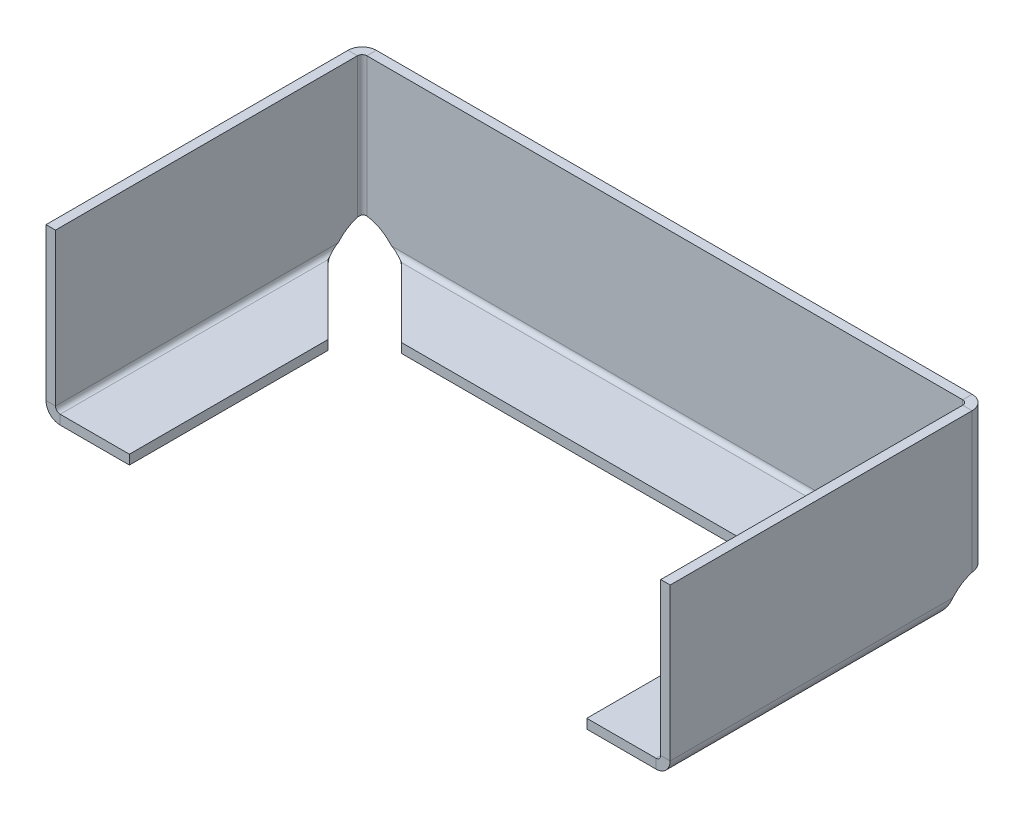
ISO-10303-21;
HEADER;
FILE_DESCRIPTION(('STEP AP214'),'2;1');
FILE_NAME('part.step','',(''),(''),'','','');
FILE_SCHEMA(('AUTOMOTIVE_DESIGN { 1 0 10303 214 1 1 1 1 }'));
ENDSEC;
DATA;
#1=APPLICATION_CONTEXT('core data for automotive mechanical design processes');
#2=APPLICATION_PROTOCOL_DEFINITION('international standard','automotive_design',2000,#1);
#3=PRODUCT_CONTEXT('',#1,'mechanical');
#4=PRODUCT('Part','Part','',(#3));
#5=PRODUCT_RELATED_PRODUCT_CATEGORY('part','',(#4));
#6=PRODUCT_DEFINITION_FORMATION('','',#4);
#7=PRODUCT_DEFINITION_CONTEXT('part definition',#1,'design');
#8=PRODUCT_DEFINITION('design','',#6,#7);
#9=PRODUCT_DEFINITION_SHAPE('','',#8);
#10=(LENGTH_UNIT() NAMED_UNIT(*) SI_UNIT(.MILLI.,.METRE.));
#11=(NAMED_UNIT(*) PLANE_ANGLE_UNIT() SI_UNIT($,.RADIAN.));
#12=(NAMED_UNIT(*) SI_UNIT($,.STERADIAN.) SOLID_ANGLE_UNIT());
#13=UNCERTAINTY_MEASURE_WITH_UNIT(LENGTH_MEASURE(1.E-05),#10,'distance_accuracy_value','');
#14=(GEOMETRIC_REPRESENTATION_CONTEXT(3) GLOBAL_UNCERTAINTY_ASSIGNED_CONTEXT((#13)) GLOBAL_UNIT_ASSIGNED_CONTEXT((#10,
#11,#12)) REPRESENTATION_CONTEXT('',''));
#15=CARTESIAN_POINT('',(0.,0.,0.));
#16=DIRECTION('',(0.,0.,1.));
#17=DIRECTION('',(1.,0.,0.));
#18=AXIS2_PLACEMENT_3D('',#15,#16,#17);
#19=CARTESIAN_POINT('',(-32.,-18.6568542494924,1.));
#20=DIRECTION('',(0.,0.,-1.));
#21=DIRECTION('',(-1.,0.,0.));
#22=AXIS2_PLACEMENT_3D('',#19,#20,#21);
#23=PLANE('',#22);
#24=CARTESIAN_POINT('',(32.,-18.6568542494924,1.));
#25=DIRECTION('',(0.,0.,-1.));
#26=DIRECTION('',(-1.,0.,0.));
#27=AXIS2_PLACEMENT_3D('',#24,#25,#26);
#28=CIRCLE('',#27,4.);
#29=CARTESIAN_POINT('',(29.1715728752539,-15.8284271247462,1.));
#30=VERTEX_POINT('',#29);
#31=CARTESIAN_POINT('',(31.5,-14.6882272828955,0.999999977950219));
#32=VERTEX_POINT('',#31);
#33=EDGE_CURVE('E933',#30,#32,#28,.T.);
#34=ORIENTED_EDGE('',*,*,#33,.T.);
#35=DIRECTION('',(0.,1.,0.));
#36=VECTOR('',#35,1.);
#37=CARTESIAN_POINT('',(31.5,-18.6568542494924,1.));
#38=LINE('',#37,#36);
#39=CARTESIAN_POINT('',(31.5,0.,0.99999998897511));
#40=VERTEX_POINT('',#39);
#41=EDGE_CURVE('E1035',#32,#40,#38,.T.);
#42=ORIENTED_EDGE('',*,*,#41,.T.);
#43=DIRECTION('',(-1.,0.,0.));
#44=VECTOR('',#43,1.);
#45=CARTESIAN_POINT('',(-65.,0.,1.));
#46=LINE('',#45,#44);
#47=CARTESIAN_POINT('',(-31.5,0.,1.));
#48=VERTEX_POINT('',#47);
#49=EDGE_CURVE('E1038',#40,#48,#46,.T.);
#50=ORIENTED_EDGE('',*,*,#49,.T.);
#51=DIRECTION('',(0.,1.,0.));
#52=VECTOR('',#51,1.);
#53=CARTESIAN_POINT('',(-31.5,-18.6568542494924,1.));
#54=LINE('',#53,#52);
#55=CARTESIAN_POINT('',(-31.5,-14.6882272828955,0.999999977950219));
#56=VERTEX_POINT('',#55);
#57=EDGE_CURVE('E898',#56,#48,#54,.T.);
#58=ORIENTED_EDGE('',*,*,#57,.F.);
#59=CARTESIAN_POINT('',(-32.,-18.6568542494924,1.));
#60=DIRECTION('',(0.,0.,-1.));
#61=DIRECTION('',(-1.,0.,0.));
#62=AXIS2_PLACEMENT_3D('',#59,#60,#61);
#63=CIRCLE('',#62,4.);
#64=CARTESIAN_POINT('',(-29.1715728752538,-15.8284271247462,1.));
#65=VERTEX_POINT('',#64);
#66=EDGE_CURVE('E938',#56,#65,#63,.T.);
#67=ORIENTED_EDGE('',*,*,#66,.T.);
#68=DIRECTION('',(0.707106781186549,-0.707106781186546,0.));
#69=VECTOR('',#68,1.);
#70=CARTESIAN_POINT('',(-29.1715728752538,-15.8284271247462,1.));
#71=LINE('',#70,#69);
#72=CARTESIAN_POINT('',(-28.8889003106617,-16.1110996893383,0.999999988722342));
#73=VERTEX_POINT('',#72);
#74=EDGE_CURVE('E929',#65,#73,#71,.T.);
#75=ORIENTED_EDGE('',*,*,#74,.T.);
#76=DIRECTION('',(1.,0.,0.));
#77=VECTOR('',#76,1.);
#78=CARTESIAN_POINT('',(-32.,-16.1110996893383,1.));
#79=LINE('',#78,#77);
#80=CARTESIAN_POINT('',(28.8889003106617,-16.1110996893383,0.999999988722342));
#81=VERTEX_POINT('',#80);
#82=EDGE_CURVE('E920',#73,#81,#79,.T.);
#83=ORIENTED_EDGE('',*,*,#82,.T.);
#84=DIRECTION('',(0.707106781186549,0.707106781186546,0.));
#85=VECTOR('',#84,1.);
#86=CARTESIAN_POINT('',(29.1715728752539,-15.8284271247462,1.));
#87=LINE('',#86,#85);
#88=EDGE_CURVE('E928',#81,#30,#87,.T.);
#89=ORIENTED_EDGE('',*,*,#88,.T.);
#90=EDGE_LOOP('',(#34,#42,#50,#58,#67,#75,#83,#89));
#91=FACE_BOUND('',#90,.T.);
#92=ADVANCED_FACE('F83',(#91),#23,.F.);
#93=CARTESIAN_POINT('',(32.,-18.6568542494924,1.));
#94=DIRECTION('',(0.,0.,-1.));
#95=DIRECTION('',(-1.,0.,0.));
#96=AXIS2_PLACEMENT_3D('',#93,#94,#95);
#97=CYLINDRICAL_SURFACE('',#96,4.);
#98=CARTESIAN_POINT('',(32.,-18.6568542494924,0.));
#99=DIRECTION('',(0.,0.,-1.));
#100=DIRECTION('',(-1.,0.,0.));
#101=AXIS2_PLACEMENT_3D('',#98,#99,#100);
#102=CIRCLE('',#101,4.);
#103=CARTESIAN_POINT('',(29.1715728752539,-15.8284271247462,0.));
#104=VERTEX_POINT('',#103);
#105=CARTESIAN_POINT('',(31.5,-14.6882272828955,-2.20497808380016E-08));
#106=VERTEX_POINT('',#105);
#107=EDGE_CURVE('E902',#104,#106,#102,.T.);
#108=ORIENTED_EDGE('',*,*,#107,.T.);
#109=CARTESIAN_POINT('',(31.5,-14.6882272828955,0.999999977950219));
#110=CARTESIAN_POINT('',(31.5,-14.6882272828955,-2.20497808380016E-08));
#111=B_SPLINE_CURVE_WITH_KNOTS('',1,(#109,#110),.UNSPECIFIED.,.F.,.F.,(2,2),(0.,1.),.UNSPECIFIED.);
#112=EDGE_CURVE('E458',#106,#32,#111,.F.);
#113=ORIENTED_EDGE('',*,*,#112,.T.);
#114=ORIENTED_EDGE('',*,*,#33,.F.);
#115=DIRECTION('',(0.,0.,-1.));
#116=VECTOR('',#115,1.);
#117=CARTESIAN_POINT('',(29.1715728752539,-15.8284271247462,1.));
#118=LINE('',#117,#116);
#119=EDGE_CURVE('E899',#30,#104,#118,.T.);
#120=ORIENTED_EDGE('',*,*,#119,.T.);
#121=EDGE_LOOP('',(#108,#113,#114,#120));
#122=FACE_BOUND('',#121,.T.);
#123=ADVANCED_FACE('F1024',(#122),#97,.F.);
#124=CARTESIAN_POINT('',(-65.,0.,1.));
#125=DIRECTION('',(0.,-1.,0.));
#126=DIRECTION('',(0.,0.,-1.));
#127=AXIS2_PLACEMENT_3D('',#124,#125,#126);
#128=PLANE('',#127);
#129=ORIENTED_EDGE('',*,*,#49,.F.);
#130=DIRECTION('',(0.,0.,-1.));
#131=VECTOR('',#130,1.);
#132=CARTESIAN_POINT('',(31.5,0.,1.));
#133=LINE('',#132,#131);
#134=CARTESIAN_POINT('',(31.5,0.,0.));
#135=VERTEX_POINT('',#134);
#136=EDGE_CURVE('E12',#40,#135,#133,.T.);
#137=ORIENTED_EDGE('',*,*,#136,.T.);
#138=DIRECTION('',(-1.,0.,0.));
#139=VECTOR('',#138,1.);
#140=CARTESIAN_POINT('',(-65.,0.,0.));
#141=LINE('',#140,#139);
#142=CARTESIAN_POINT('',(-31.5,0.,0.));
#143=VERTEX_POINT('',#142);
#144=EDGE_CURVE('E905',#135,#143,#141,.T.);
#145=ORIENTED_EDGE('',*,*,#144,.T.);
#146=DIRECTION('',(0.,0.,-1.));
#147=VECTOR('',#146,1.);
#148=CARTESIAN_POINT('',(-31.5,0.,1.));
#149=LINE('',#148,#147);
#150=EDGE_CURVE('E977',#48,#143,#149,.T.);
#151=ORIENTED_EDGE('',*,*,#150,.F.);
#152=EDGE_LOOP('',(#129,#137,#145,#151));
#153=FACE_BOUND('',#152,.T.);
#154=ADVANCED_FACE('F85',(#153),#128,.F.);
#155=CARTESIAN_POINT('',(-32.,-18.6568542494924,0.));
#156=DIRECTION('',(0.,0.,-1.));
#157=DIRECTION('',(-1.,0.,0.));
#158=AXIS2_PLACEMENT_3D('',#155,#156,#157);
#159=PLANE('',#158);
#160=DIRECTION('',(0.,1.,0.));
#161=VECTOR('',#160,1.);
#162=CARTESIAN_POINT('',(31.5,-18.6568542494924,0.));
#163=LINE('',#162,#161);
#164=EDGE_CURVE('E92',#106,#135,#163,.T.);
#165=ORIENTED_EDGE('',*,*,#164,.F.);
#166=ORIENTED_EDGE('',*,*,#107,.F.);
#167=DIRECTION('',(0.707106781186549,0.707106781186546,0.));
#168=VECTOR('',#167,1.);
#169=CARTESIAN_POINT('',(29.1715728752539,-15.8284271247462,0.));
#170=LINE('',#169,#168);
#171=CARTESIAN_POINT('',(28.8889003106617,-16.1110996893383,0.));
#172=VERTEX_POINT('',#171);
#173=EDGE_CURVE('E909',#172,#104,#170,.T.);
#174=ORIENTED_EDGE('',*,*,#173,.F.);
#175=DIRECTION('',(1.,0.,0.));
#176=VECTOR('',#175,1.);
#177=CARTESIAN_POINT('',(-32.,-16.1110996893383,0.));
#178=LINE('',#177,#176);
#179=CARTESIAN_POINT('',(-28.8889003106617,-16.1110996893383,-1.12776576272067E-08));
#180=VERTEX_POINT('',#179);
#181=EDGE_CURVE('E903',#180,#172,#178,.T.);
#182=ORIENTED_EDGE('',*,*,#181,.F.);
#183=DIRECTION('',(0.707106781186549,-0.707106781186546,0.));
#184=VECTOR('',#183,1.);
#185=CARTESIAN_POINT('',(-29.1715728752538,-15.8284271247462,0.));
#186=LINE('',#185,#184);
#187=CARTESIAN_POINT('',(-29.1715728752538,-15.8284271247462,0.));
#188=VERTEX_POINT('',#187);
#189=EDGE_CURVE('E911',#188,#180,#186,.T.);
#190=ORIENTED_EDGE('',*,*,#189,.F.);
#191=CARTESIAN_POINT('',(-32.,-18.6568542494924,0.));
#192=DIRECTION('',(0.,0.,-1.));
#193=DIRECTION('',(-1.,0.,0.));
#194=AXIS2_PLACEMENT_3D('',#191,#192,#193);
#195=CIRCLE('',#194,4.);
#196=CARTESIAN_POINT('',(-31.5,-14.6882272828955,0.));
#197=VERTEX_POINT('',#196);
#198=EDGE_CURVE('E107',#197,#188,#195,.T.);
#199=ORIENTED_EDGE('',*,*,#198,.F.);
#200=DIRECTION('',(0.,1.,0.));
#201=VECTOR('',#200,1.);
#202=CARTESIAN_POINT('',(-31.5,-18.6568542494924,0.));
#203=LINE('',#202,#201);
#204=EDGE_CURVE('E969',#197,#143,#203,.T.);
#205=ORIENTED_EDGE('',*,*,#204,.T.);
#206=ORIENTED_EDGE('',*,*,#144,.F.);
#207=EDGE_LOOP('',(#165,#166,#174,#182,#190,#199,#205,#206));
#208=FACE_BOUND('',#207,.T.);
#209=ADVANCED_FACE('F960',(#208),#159,.T.);
#210=CARTESIAN_POINT('',(-32.,-18.6568542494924,1.));
#211=DIRECTION('',(0.,0.,-1.));
#212=DIRECTION('',(-1.,0.,0.));
#213=AXIS2_PLACEMENT_3D('',#210,#211,#212);
#214=CYLINDRICAL_SURFACE('',#213,4.);
#215=CARTESIAN_POINT('',(-31.5,-14.6882272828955,-2.20497808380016E-08));
#216=CARTESIAN_POINT('',(-31.5,-14.6882272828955,0.999999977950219));
#217=B_SPLINE_CURVE_WITH_KNOTS('',1,(#215,#216),.UNSPECIFIED.,.F.,.F.,(2,2),(0.,1.),.UNSPECIFIED.);
#218=EDGE_CURVE('E976',#197,#56,#217,.T.);
#219=ORIENTED_EDGE('',*,*,#218,.F.);
#220=ORIENTED_EDGE('',*,*,#198,.T.);
#221=DIRECTION('',(0.,0.,-1.));
#222=VECTOR('',#221,1.);
#223=CARTESIAN_POINT('',(-29.1715728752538,-15.8284271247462,1.));
#224=LINE('',#223,#222);
#225=EDGE_CURVE('E890',#65,#188,#224,.T.);
#226=ORIENTED_EDGE('',*,*,#225,.F.);
#227=ORIENTED_EDGE('',*,*,#66,.F.);
#228=EDGE_LOOP('',(#219,#220,#226,#227));
#229=FACE_BOUND('',#228,.T.);
#230=ADVANCED_FACE('F956',(#229),#214,.F.);
#231=CARTESIAN_POINT('',(29.1715728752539,-15.8284271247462,1.));
#232=DIRECTION('',(-0.707106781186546,0.707106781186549,0.));
#233=DIRECTION('',(-0.707106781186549,-0.707106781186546,0.));
#234=AXIS2_PLACEMENT_3D('',#231,#232,#233);
#235=PLANE('',#234);
#236=ORIENTED_EDGE('',*,*,#88,.F.);
#237=CARTESIAN_POINT('',(28.8889003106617,-16.1110996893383,-1.12776576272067E-08));
#238=CARTESIAN_POINT('',(28.8889003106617,-16.1110996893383,0.999999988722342));
#239=B_SPLINE_CURVE_WITH_KNOTS('',1,(#237,#238),.UNSPECIFIED.,.F.,.F.,(2,2),(0.,1.),.UNSPECIFIED.);
#240=EDGE_CURVE('E886',#81,#172,#239,.F.);
#241=ORIENTED_EDGE('',*,*,#240,.T.);
#242=ORIENTED_EDGE('',*,*,#173,.T.);
#243=ORIENTED_EDGE('',*,*,#119,.F.);
#244=EDGE_LOOP('',(#236,#241,#242,#243));
#245=FACE_BOUND('',#244,.T.);
#246=ADVANCED_FACE('F845',(#245),#235,.F.);
#247=CARTESIAN_POINT('',(-29.1715728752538,-15.8284271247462,1.));
#248=DIRECTION('',(0.707106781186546,0.707106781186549,0.));
#249=DIRECTION('',(-0.707106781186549,0.707106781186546,0.));
#250=AXIS2_PLACEMENT_3D('',#247,#248,#249);
#251=PLANE('',#250);
#252=ORIENTED_EDGE('',*,*,#189,.T.);
#253=CARTESIAN_POINT('',(-28.8889003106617,-16.1110996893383,0.999999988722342));
#254=CARTESIAN_POINT('',(-28.8889003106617,-16.1110996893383,-1.12776576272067E-08));
#255=B_SPLINE_CURVE_WITH_KNOTS('',1,(#253,#254),.UNSPECIFIED.,.F.,.F.,(2,2),(0.,1.),.UNSPECIFIED.);
#256=EDGE_CURVE('E872',#180,#73,#255,.F.);
#257=ORIENTED_EDGE('',*,*,#256,.T.);
#258=ORIENTED_EDGE('',*,*,#74,.F.);
#259=ORIENTED_EDGE('',*,*,#225,.T.);
#260=EDGE_LOOP('',(#252,#257,#258,#259));
#261=FACE_BOUND('',#260,.T.);
#262=ADVANCED_FACE('F844',(#261),#251,.F.);
#263=CARTESIAN_POINT('',(-28.8889003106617,-16.1110996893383,-1.12776576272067E-08));
#264=CARTESIAN_POINT('',(-28.7579842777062,-16.3074737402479,-1.12776576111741E-08));
#265=CARTESIAN_POINT('',(-28.6271009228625,-16.5037215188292,0.0390409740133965));
#266=CARTESIAN_POINT('',(-28.3653015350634,-16.8665281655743,0.18932040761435));
#267=CARTESIAN_POINT('',(-28.2344018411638,-17.0329197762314,0.300499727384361));
#268=CARTESIAN_POINT('',(-27.9726024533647,-17.310599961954,0.57817991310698));
#269=CARTESIAN_POINT('',(-27.8417027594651,-17.421779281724,0.744571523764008));
#270=CARTESIAN_POINT('',(-27.5799033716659,-17.5720587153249,1.10737817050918));
#271=CARTESIAN_POINT('',(-27.4490200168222,-17.611099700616,1.3036259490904));
#272=CARTESIAN_POINT('',(-27.3181039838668,-17.611099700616,1.5));
#273=CARTESIAN_POINT('',(-28.8889003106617,-16.1110996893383,0.999999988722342));
#274=CARTESIAN_POINT('',(-28.7579958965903,-16.1765518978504,0.999999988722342));
#275=CARTESIAN_POINT('',(-28.6271009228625,-16.2419736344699,1.01301365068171));
#276=CARTESIAN_POINT('',(-28.3653015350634,-16.3629091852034,1.06310679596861));
#277=CARTESIAN_POINT('',(-28.2344018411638,-16.4183730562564,1.10016656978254));
#278=CARTESIAN_POINT('',(-27.9726024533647,-16.5109331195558,1.19272663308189));
#279=CARTESIAN_POINT('',(-27.8417027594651,-16.5479928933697,1.24819050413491));
#280=CARTESIAN_POINT('',(-27.5799033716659,-16.5980860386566,1.36912605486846));
#281=CARTESIAN_POINT('',(-27.4490083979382,-16.611099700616,1.434547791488));
#282=CARTESIAN_POINT('',(-27.3181039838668,-16.611099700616,1.5));
#283=B_SPLINE_SURFACE_WITH_KNOTS('',1,3,((#263,#264,#265,#266,#267,#268,#269,#270,#271,#272),
(#273,#274,#275,#276,#277,#278,#279,#280,#281,#282)),.UNSPECIFIED.,.F.,.F.,.F.,(2,2),(4,2,2,2,
4),(0.,1.),(0.,0.25,0.5,0.75,1.),.UNSPECIFIED.);
#284=CARTESIAN_POINT('',(-28.8889003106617,-16.1110996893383,-1.12776576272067E-08));
#285=CARTESIAN_POINT('',(-28.7579842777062,-16.3074737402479,-1.12776576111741E-08));
#286=CARTESIAN_POINT('',(-28.6271009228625,-16.5037215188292,0.0390409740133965));
#287=CARTESIAN_POINT('',(-28.3653015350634,-16.8665281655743,0.18932040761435));
#288=CARTESIAN_POINT('',(-28.2344018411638,-17.0329197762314,0.300499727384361));
#289=CARTESIAN_POINT('',(-27.9726024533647,-17.310599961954,0.57817991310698));
#290=CARTESIAN_POINT('',(-27.8417027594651,-17.421779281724,0.744571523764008));
#291=CARTESIAN_POINT('',(-27.5799033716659,-17.5720587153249,1.10737817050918));
#292=CARTESIAN_POINT('',(-27.4490200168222,-17.611099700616,1.3036259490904));
#293=CARTESIAN_POINT('',(-27.3181039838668,-17.611099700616,1.5));
#294=B_SPLINE_CURVE_WITH_KNOTS('',3,(#284,#285,#286,#287,#288,#289,#290,#291,#292,#293),
.UNSPECIFIED.,.F.,.F.,(4,2,2,2,4),(0.,0.25,0.5,0.75,1.),.UNSPECIFIED.);
#295=CARTESIAN_POINT('',(-27.3181039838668,-17.6110996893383,1.5));
#296=VERTEX_POINT('',#295);
#297=EDGE_CURVE('E816',#180,#296,#294,.T.);
#298=CARTESIAN_POINT('',(-27.3181039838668,-17.611099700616,1.5));
#299=CARTESIAN_POINT('',(-27.3181039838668,-16.611099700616,1.5));
#300=B_SPLINE_CURVE_WITH_KNOTS('',1,(#298,#299),.UNSPECIFIED.,.F.,.F.,(2,2),(0.,1.),.UNSPECIFIED.);
#301=CARTESIAN_POINT('',(-27.3181039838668,-16.6110996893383,1.5));
#302=VERTEX_POINT('',#301);
#303=EDGE_CURVE('E766',#296,#302,#300,.T.);
#304=CARTESIAN_POINT('',(-27.3181039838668,-16.611099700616,1.5));
#305=CARTESIAN_POINT('',(-27.4490083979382,-16.611099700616,1.434547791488));
#306=CARTESIAN_POINT('',(-27.5799033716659,-16.5980860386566,1.36912605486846));
#307=CARTESIAN_POINT('',(-27.8417027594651,-16.5479928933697,1.24819050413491));
#308=CARTESIAN_POINT('',(-27.9726024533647,-16.5109331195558,1.19272663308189));
#309=CARTESIAN_POINT('',(-28.2344018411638,-16.4183730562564,1.10016656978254));
#310=CARTESIAN_POINT('',(-28.3653015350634,-16.3629091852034,1.06310679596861));
#311=CARTESIAN_POINT('',(-28.6271009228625,-16.2419736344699,1.01301365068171));
#312=CARTESIAN_POINT('',(-28.7579958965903,-16.1765518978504,0.999999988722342));
#313=CARTESIAN_POINT('',(-28.8889003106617,-16.1110996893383,0.999999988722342));
#314=B_SPLINE_CURVE_WITH_KNOTS('',3,(#304,#305,#306,#307,#308,#309,#310,#311,#312,#313),
.UNSPECIFIED.,.F.,.F.,(4,2,2,2,4),(0.,0.25,0.5,0.75,1.),.UNSPECIFIED.);
#315=EDGE_CURVE('E810',#73,#302,#314,.F.);
#316=ORIENTED_EDGE('',*,*,#256,.F.);
#317=ORIENTED_EDGE('',*,*,#297,.T.);
#318=ORIENTED_EDGE('',*,*,#303,.T.);
#319=ORIENTED_EDGE('',*,*,#315,.F.);
#320=EDGE_LOOP('',(#316,#317,#318,#319));
#321=FACE_BOUND('',#320,.T.);
#322=ADVANCED_FACE('F833',(#321),#283,.F.);
#323=CARTESIAN_POINT('',(27.3181039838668,-17.611099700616,1.5));
#324=CARTESIAN_POINT('',(27.4490200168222,-17.611099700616,1.30362594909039));
#325=CARTESIAN_POINT('',(27.5799033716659,-17.5720587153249,1.10737817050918));
#326=CARTESIAN_POINT('',(27.8417027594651,-17.421779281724,0.744571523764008));
#327=CARTESIAN_POINT('',(27.9726024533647,-17.310599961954,0.57817991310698));
#328=CARTESIAN_POINT('',(28.2344018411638,-17.0329197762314,0.300499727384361));
#329=CARTESIAN_POINT('',(28.3653015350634,-16.8665281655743,0.18932040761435));
#330=CARTESIAN_POINT('',(28.6271009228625,-16.5037215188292,0.0390409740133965));
#331=CARTESIAN_POINT('',(28.7579842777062,-16.307473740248,-1.12776576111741E-08));
#332=CARTESIAN_POINT('',(28.8889003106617,-16.1110996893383,-1.12776576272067E-08));
#333=CARTESIAN_POINT('',(27.3181039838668,-16.611099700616,1.5));
#334=CARTESIAN_POINT('',(27.4490083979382,-16.611099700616,1.43454779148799));
#335=CARTESIAN_POINT('',(27.5799033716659,-16.5980860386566,1.36912605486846));
#336=CARTESIAN_POINT('',(27.8417027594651,-16.5479928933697,1.24819050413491));
#337=CARTESIAN_POINT('',(27.9726024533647,-16.5109331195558,1.19272663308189));
#338=CARTESIAN_POINT('',(28.2344018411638,-16.4183730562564,1.10016656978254));
#339=CARTESIAN_POINT('',(28.3653015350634,-16.3629091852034,1.06310679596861));
#340=CARTESIAN_POINT('',(28.6271009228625,-16.2419736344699,1.01301365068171));
#341=CARTESIAN_POINT('',(28.7579958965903,-16.1765518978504,0.999999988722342));
#342=CARTESIAN_POINT('',(28.8889003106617,-16.1110996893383,0.999999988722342));
#343=B_SPLINE_SURFACE_WITH_KNOTS('',1,3,((#323,#324,#325,#326,#327,#328,#329,#330,#331,#332),
(#333,#334,#335,#336,#337,#338,#339,#340,#341,#342)),.UNSPECIFIED.,.F.,.F.,.F.,(2,2),(4,2,2,2,
4),(0.,1.),(0.,0.25,0.5,0.75,1.),.UNSPECIFIED.);
#344=CARTESIAN_POINT('',(27.3181039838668,-16.611099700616,1.5));
#345=CARTESIAN_POINT('',(27.3181039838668,-17.611099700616,1.5));
#346=B_SPLINE_CURVE_WITH_KNOTS('',1,(#344,#345),.UNSPECIFIED.,.F.,.F.,(2,2),(0.,1.),.UNSPECIFIED.);
#347=CARTESIAN_POINT('',(27.3181039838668,-16.611099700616,1.5));
#348=VERTEX_POINT('',#347);
#349=CARTESIAN_POINT('',(27.3181039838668,-17.6110996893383,1.5));
#350=VERTEX_POINT('',#349);
#351=EDGE_CURVE('E1621',#348,#350,#346,.T.);
#352=CARTESIAN_POINT('',(27.3181039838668,-17.611099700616,1.5));
#353=CARTESIAN_POINT('',(27.4490200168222,-17.611099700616,1.30362594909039));
#354=CARTESIAN_POINT('',(27.5799033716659,-17.5720587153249,1.10737817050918));
#355=CARTESIAN_POINT('',(27.8417027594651,-17.421779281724,0.744571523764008));
#356=CARTESIAN_POINT('',(27.9726024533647,-17.310599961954,0.57817991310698));
#357=CARTESIAN_POINT('',(28.2344018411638,-17.0329197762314,0.300499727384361));
#358=CARTESIAN_POINT('',(28.3653015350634,-16.8665281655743,0.18932040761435));
#359=CARTESIAN_POINT('',(28.6271009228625,-16.5037215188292,0.0390409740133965));
#360=CARTESIAN_POINT('',(28.7579842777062,-16.307473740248,-1.12776576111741E-08));
#361=CARTESIAN_POINT('',(28.8889003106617,-16.1110996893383,-1.12776576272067E-08));
#362=B_SPLINE_CURVE_WITH_KNOTS('',3,(#352,#353,#354,#355,#356,#357,#358,#359,#360,#361),
.UNSPECIFIED.,.F.,.F.,(4,2,2,2,4),(0.,0.25,0.5,0.75,1.),.UNSPECIFIED.);
#363=EDGE_CURVE('E1619',#350,#172,#362,.T.);
#364=CARTESIAN_POINT('',(28.8889003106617,-16.1110996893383,0.999999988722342));
#365=CARTESIAN_POINT('',(28.7579958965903,-16.1765518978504,0.999999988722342));
#366=CARTESIAN_POINT('',(28.6271009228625,-16.2419736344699,1.01301365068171));
#367=CARTESIAN_POINT('',(28.3653015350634,-16.3629091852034,1.06310679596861));
#368=CARTESIAN_POINT('',(28.2344018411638,-16.4183730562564,1.10016656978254));
#369=CARTESIAN_POINT('',(27.9726024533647,-16.5109331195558,1.19272663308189));
#370=CARTESIAN_POINT('',(27.8417027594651,-16.5479928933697,1.24819050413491));
#371=CARTESIAN_POINT('',(27.5799033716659,-16.5980860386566,1.36912605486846));
#372=CARTESIAN_POINT('',(27.4490083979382,-16.611099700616,1.43454779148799));
#373=CARTESIAN_POINT('',(27.3181039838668,-16.611099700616,1.5));
#374=B_SPLINE_CURVE_WITH_KNOTS('',3,(#364,#365,#366,#367,#368,#369,#370,#371,#372,#373),
.UNSPECIFIED.,.F.,.F.,(4,2,2,2,4),(0.,0.25,0.5,0.75,1.),.UNSPECIFIED.);
#375=EDGE_CURVE('E906',#348,#81,#374,.F.);
#376=ORIENTED_EDGE('',*,*,#351,.T.);
#377=ORIENTED_EDGE('',*,*,#363,.T.);
#378=ORIENTED_EDGE('',*,*,#240,.F.);
#379=ORIENTED_EDGE('',*,*,#375,.F.);
#380=EDGE_LOOP('',(#376,#377,#378,#379));
#381=FACE_BOUND('',#380,.T.);
#382=ADVANCED_FACE('F784',(#381),#343,.F.);
#383=CARTESIAN_POINT('',(-57.8077991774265,-16.1110996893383,1.5));
#384=DIRECTION('',(1.,0.,0.));
#385=DIRECTION('',(0.,0.,-1.));
#386=AXIS2_PLACEMENT_3D('',#383,#384,#385);
#387=CYLINDRICAL_SURFACE('',#386,0.500000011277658);
#388=ORIENTED_EDGE('',*,*,#375,.T.);
#389=ORIENTED_EDGE('',*,*,#82,.F.);
#390=ORIENTED_EDGE('',*,*,#315,.T.);
#391=DIRECTION('',(1.,0.,0.));
#392=VECTOR('',#391,1.);
#393=CARTESIAN_POINT('',(-32.,-16.6110996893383,1.5));
#394=LINE('',#393,#392);
#395=EDGE_CURVE('E681',#302,#348,#394,.T.);
#396=ORIENTED_EDGE('',*,*,#395,.T.);
#397=EDGE_LOOP('',(#388,#389,#390,#396));
#398=FACE_BOUND('',#397,.T.);
#399=ADVANCED_FACE('F773',(#398),#387,.F.);
#400=CARTESIAN_POINT('',(-57.8077991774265,-16.1110996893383,1.5));
#401=DIRECTION('',(1.,0.,0.));
#402=DIRECTION('',(0.,0.,-1.));
#403=AXIS2_PLACEMENT_3D('',#400,#401,#402);
#404=CYLINDRICAL_SURFACE('',#403,1.50000001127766);
#405=ORIENTED_EDGE('',*,*,#363,.F.);
#406=DIRECTION('',(1.,0.,0.));
#407=VECTOR('',#406,1.);
#408=CARTESIAN_POINT('',(-32.,-17.6110996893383,1.5));
#409=LINE('',#408,#407);
#410=EDGE_CURVE('E756',#296,#350,#409,.T.);
#411=ORIENTED_EDGE('',*,*,#410,.F.);
#412=ORIENTED_EDGE('',*,*,#297,.F.);
#413=ORIENTED_EDGE('',*,*,#181,.T.);
#414=EDGE_LOOP('',(#405,#411,#412,#413));
#415=FACE_BOUND('',#414,.T.);
#416=ADVANCED_FACE('F783',(#415),#404,.T.);
#417=CARTESIAN_POINT('',(-20.,-16.6110996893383,8.81810398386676));
#418=DIRECTION('',(0.,0.,-1.));
#419=DIRECTION('',(-1.,0.,0.));
#420=AXIS2_PLACEMENT_3D('',#417,#418,#419);
#421=PLANE('',#420);
#422=DIRECTION('',(1.,0.,0.));
#423=VECTOR('',#422,1.);
#424=CARTESIAN_POINT('',(-20.,-17.6110996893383,8.81810398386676));
#425=LINE('',#424,#423);
#426=CARTESIAN_POINT('',(-20.,-17.6110996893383,8.81810398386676));
#427=VERTEX_POINT('',#426);
#428=CARTESIAN_POINT('',(20.,-17.6110996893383,8.81810398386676));
#429=VERTEX_POINT('',#428);
#430=EDGE_CURVE('E764',#427,#429,#425,.T.);
#431=ORIENTED_EDGE('',*,*,#430,.T.);
#432=DIRECTION('',(0.,-1.,0.));
#433=VECTOR('',#432,1.);
#434=CARTESIAN_POINT('',(20.,-16.6110996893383,8.81810398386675));
#435=LINE('',#434,#433);
#436=CARTESIAN_POINT('',(20.,-16.6110996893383,8.81810398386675));
#437=VERTEX_POINT('',#436);
#438=EDGE_CURVE('E747',#437,#429,#435,.T.);
#439=ORIENTED_EDGE('',*,*,#438,.F.);
#440=DIRECTION('',(1.,0.,0.));
#441=VECTOR('',#440,1.);
#442=CARTESIAN_POINT('',(-20.,-16.6110996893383,8.81810398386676));
#443=LINE('',#442,#441);
#444=CARTESIAN_POINT('',(-20.,-16.6110996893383,8.81810398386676));
#445=VERTEX_POINT('',#444);
#446=EDGE_CURVE('E757',#445,#437,#443,.T.);
#447=ORIENTED_EDGE('',*,*,#446,.F.);
#448=DIRECTION('',(0.,-1.,0.));
#449=VECTOR('',#448,1.);
#450=CARTESIAN_POINT('',(-20.,-16.6110996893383,8.81810398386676));
#451=LINE('',#450,#449);
#452=EDGE_CURVE('E761',#445,#427,#451,.T.);
#453=ORIENTED_EDGE('',*,*,#452,.T.);
#454=EDGE_LOOP('',(#431,#439,#447,#453));
#455=FACE_BOUND('',#454,.T.);
#456=ADVANCED_FACE('F1547',(#455),#421,.F.);
#457=CARTESIAN_POINT('',(-32.,-16.6110996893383,2.47495823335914));
#458=DIRECTION('',(0.,-1.,0.));
#459=DIRECTION('',(-1.,0.,0.));
#460=AXIS2_PLACEMENT_3D('',#457,#458,#459);
#461=PLANE('',#460);
#462=ORIENTED_EDGE('',*,*,#395,.F.);
#463=DIRECTION('',(0.707106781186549,0.,0.707106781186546));
#464=VECTOR('',#463,1.);
#465=CARTESIAN_POINT('',(-29.1715728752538,-16.6110996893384,-0.353468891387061));
#466=LINE('',#465,#464);
#467=EDGE_CURVE('E760',#302,#445,#466,.T.);
#468=ORIENTED_EDGE('',*,*,#467,.T.);
#469=ORIENTED_EDGE('',*,*,#446,.T.);
#470=DIRECTION('',(0.707106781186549,0.,-0.707106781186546));
#471=VECTOR('',#470,1.);
#472=CARTESIAN_POINT('',(29.1715728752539,-16.6110996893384,-0.353468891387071));
#473=LINE('',#472,#471);
#474=EDGE_CURVE('E759',#437,#348,#473,.T.);
#475=ORIENTED_EDGE('',*,*,#474,.T.);
#476=EDGE_LOOP('',(#462,#468,#469,#475));
#477=FACE_BOUND('',#476,.T.);
#478=ADVANCED_FACE('F1541',(#477),#461,.F.);
#479=CARTESIAN_POINT('',(-29.1715728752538,-16.6110996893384,-0.353468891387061));
#480=DIRECTION('',(0.707106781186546,0.,-0.707106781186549));
#481=DIRECTION('',(-0.707106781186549,0.,-0.707106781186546));
#482=AXIS2_PLACEMENT_3D('',#479,#480,#481);
#483=PLANE('',#482);
#484=ORIENTED_EDGE('',*,*,#303,.F.);
#485=DIRECTION('',(0.707106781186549,0.,0.707106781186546));
#486=VECTOR('',#485,1.);
#487=CARTESIAN_POINT('',(-29.1715728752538,-17.6110996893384,-0.353468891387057));
#488=LINE('',#487,#486);
#489=EDGE_CURVE('E1673',#296,#427,#488,.T.);
#490=ORIENTED_EDGE('',*,*,#489,.T.);
#491=ORIENTED_EDGE('',*,*,#452,.F.);
#492=ORIENTED_EDGE('',*,*,#467,.F.);
#493=EDGE_LOOP('',(#484,#490,#491,#492));
#494=FACE_BOUND('',#493,.T.);
#495=ADVANCED_FACE('F1534',(#494),#483,.F.);
#496=CARTESIAN_POINT('',(-32.,-17.6110996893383,2.47495823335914));
#497=DIRECTION('',(0.,-1.,0.));
#498=DIRECTION('',(-1.,0.,0.));
#499=AXIS2_PLACEMENT_3D('',#496,#497,#498);
#500=PLANE('',#499);
#501=ORIENTED_EDGE('',*,*,#489,.F.);
#502=ORIENTED_EDGE('',*,*,#410,.T.);
#503=DIRECTION('',(0.707106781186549,0.,-0.707106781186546));
#504=VECTOR('',#503,1.);
#505=CARTESIAN_POINT('',(29.1715728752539,-17.6110996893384,-0.353468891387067));
#506=LINE('',#505,#504);
#507=EDGE_CURVE('E755',#429,#350,#506,.T.);
#508=ORIENTED_EDGE('',*,*,#507,.F.);
#509=ORIENTED_EDGE('',*,*,#430,.F.);
#510=EDGE_LOOP('',(#501,#502,#508,#509));
#511=FACE_BOUND('',#510,.T.);
#512=ADVANCED_FACE('F1528',(#511),#500,.T.);
#513=CARTESIAN_POINT('',(29.1715728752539,-16.6110996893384,-0.353468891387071));
#514=DIRECTION('',(-0.707106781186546,0.,-0.707106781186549));
#515=DIRECTION('',(-0.707106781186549,0.,0.707106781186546));
#516=AXIS2_PLACEMENT_3D('',#513,#514,#515);
#517=PLANE('',#516);
#518=ORIENTED_EDGE('',*,*,#351,.F.);
#519=ORIENTED_EDGE('',*,*,#474,.F.);
#520=ORIENTED_EDGE('',*,*,#438,.T.);
#521=ORIENTED_EDGE('',*,*,#507,.T.);
#522=EDGE_LOOP('',(#518,#519,#520,#521));
#523=FACE_BOUND('',#522,.T.);
#524=ADVANCED_FACE('F709',(#523),#517,.F.);
#525=CARTESIAN_POINT('',(-33.0000000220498,-14.8028439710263,1.50000000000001));
#526=CARTESIAN_POINT('',(-33.0000000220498,-14.772794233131,1.26334406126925));
#527=CARTESIAN_POINT('',(-32.9435932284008,-14.7479645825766,1.03867680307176));
#528=CARTESIAN_POINT('',(-32.7544590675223,-14.7084180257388,0.649639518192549));
#529=CARTESIAN_POINT('',(-32.6222473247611,-14.6937556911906,0.485547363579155));
#530=CARTESIAN_POINT('',(-32.3233273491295,-14.6746529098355,0.230872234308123));
#531=CARTESIAN_POINT('',(-32.1568822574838,-14.6702124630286,0.139990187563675));
#532=CARTESIAN_POINT('',(-31.8234283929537,-14.671553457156,0.0246983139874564));
#533=CARTESIAN_POINT('',(-31.6562797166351,-14.6773483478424,-2.20497808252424E-08));
#534=CARTESIAN_POINT('',(-31.5,-14.6882272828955,-2.20497808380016E-08));
#535=CARTESIAN_POINT('',(-32.0000000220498,-14.8028439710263,1.5));
#536=CARTESIAN_POINT('',(-32.0000000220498,-14.772800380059,1.42113082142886));
#537=CARTESIAN_POINT('',(-31.9811977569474,-14.7479645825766,1.346225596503));
#538=CARTESIAN_POINT('',(-31.918153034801,-14.7084180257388,1.21654649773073));
#539=CARTESIAN_POINT('',(-31.874082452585,-14.6937556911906,1.16184911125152));
#540=CARTESIAN_POINT('',(-31.7744424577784,-14.6746529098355,1.07695739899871));
#541=CARTESIAN_POINT('',(-31.718960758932,-14.6702124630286,1.0466633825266));
#542=CARTESIAN_POINT('',(-31.6078094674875,-14.671553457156,1.00823275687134));
#543=CARTESIAN_POINT('',(-31.5520956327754,-14.6773478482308,0.999999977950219));
#544=CARTESIAN_POINT('',(-31.5,-14.6882272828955,0.999999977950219));
#545=B_SPLINE_SURFACE_WITH_KNOTS('',1,3,((#525,#526,#527,#528,#529,#530,#531,#532,#533,#534),
(#535,#536,#537,#538,#539,#540,#541,#542,#543,#544)),.UNSPECIFIED.,.F.,.F.,.F.,(2,2),(4,2,2,2,
4),(0.,1.),(0.,0.25,0.5,0.75,1.),.UNSPECIFIED.);
#546=CARTESIAN_POINT('',(-32.0000000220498,-14.8028439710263,1.5));
#547=CARTESIAN_POINT('',(-33.0000000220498,-14.8028439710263,1.50000000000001));
#548=B_SPLINE_CURVE_WITH_KNOTS('',1,(#546,#547),.UNSPECIFIED.,.F.,.F.,(2,2),(0.,1.),.UNSPECIFIED.);
#549=CARTESIAN_POINT('',(-33.,-14.8028439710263,1.50000000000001));
#550=VERTEX_POINT('',#549);
#551=CARTESIAN_POINT('',(-32.0000000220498,-14.8028439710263,1.5));
#552=VERTEX_POINT('',#551);
#553=EDGE_CURVE('E599',#550,#552,#548,.F.);
#554=CARTESIAN_POINT('',(-33.0000000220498,-14.8028439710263,1.50000000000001));
#555=CARTESIAN_POINT('',(-33.0000000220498,-14.772794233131,1.26334406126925));
#556=CARTESIAN_POINT('',(-32.9435932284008,-14.7479645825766,1.03867680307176));
#557=CARTESIAN_POINT('',(-32.7544590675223,-14.7084180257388,0.649639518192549));
#558=CARTESIAN_POINT('',(-32.6222473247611,-14.6937556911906,0.485547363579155));
#559=CARTESIAN_POINT('',(-32.3233273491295,-14.6746529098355,0.230872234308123));
#560=CARTESIAN_POINT('',(-32.1568822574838,-14.6702124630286,0.139990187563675));
#561=CARTESIAN_POINT('',(-31.8234283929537,-14.671553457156,0.0246983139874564));
#562=CARTESIAN_POINT('',(-31.6562797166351,-14.6773483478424,-2.20497808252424E-08));
#563=CARTESIAN_POINT('',(-31.5,-14.6882272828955,-2.20497808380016E-08));
#564=B_SPLINE_CURVE_WITH_KNOTS('',3,(#554,#555,#556,#557,#558,#559,#560,#561,#562,#563),
.UNSPECIFIED.,.F.,.F.,(4,2,2,2,4),(0.,0.25,0.5,0.75,1.),.UNSPECIFIED.);
#565=EDGE_CURVE('E598',#550,#197,#564,.T.);
#566=CARTESIAN_POINT('',(-31.5,-14.6882272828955,0.999999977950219));
#567=CARTESIAN_POINT('',(-31.5520956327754,-14.6773478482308,0.999999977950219));
#568=CARTESIAN_POINT('',(-31.6078094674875,-14.671553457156,1.00823275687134));
#569=CARTESIAN_POINT('',(-31.718960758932,-14.6702124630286,1.0466633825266));
#570=CARTESIAN_POINT('',(-31.7744424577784,-14.6746529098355,1.07695739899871));
#571=CARTESIAN_POINT('',(-31.874082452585,-14.6937556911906,1.16184911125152));
#572=CARTESIAN_POINT('',(-31.918153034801,-14.7084180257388,1.21654649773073));
#573=CARTESIAN_POINT('',(-31.9811977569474,-14.7479645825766,1.346225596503));
#574=CARTESIAN_POINT('',(-32.0000000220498,-14.772800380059,1.42113082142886));
#575=CARTESIAN_POINT('',(-32.0000000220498,-14.8028439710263,1.5));
#576=B_SPLINE_CURVE_WITH_KNOTS('',3,(#566,#567,#568,#569,#570,#571,#572,#573,#574,#575),
.UNSPECIFIED.,.F.,.F.,(4,2,2,2,4),(0.,0.25,0.5,0.75,1.),.UNSPECIFIED.);
#577=EDGE_CURVE('E677',#552,#56,#576,.F.);
#578=ORIENTED_EDGE('',*,*,#553,.F.);
#579=ORIENTED_EDGE('',*,*,#565,.T.);
#580=ORIENTED_EDGE('',*,*,#218,.T.);
#581=ORIENTED_EDGE('',*,*,#577,.F.);
#582=EDGE_LOOP('',(#578,#579,#580,#581));
#583=FACE_BOUND('',#582,.T.);
#584=ADVANCED_FACE('F701',(#583),#545,.F.);
#585=CARTESIAN_POINT('',(-31.5,0.,1.50000002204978));
#586=DIRECTION('',(0.,-1.,0.));
#587=DIRECTION('',(0.,0.,-1.));
#588=AXIS2_PLACEMENT_3D('',#585,#586,#587);
#589=PLANE('',#588);
#590=CARTESIAN_POINT('',(-31.5,0.,1.5));
#591=DIRECTION('',(0.,-1.,0.));
#592=DIRECTION('',(0.,0.,-1.));
#593=AXIS2_PLACEMENT_3D('',#590,#591,#592);
#594=CIRCLE('',#593,1.50000002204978);
#595=CARTESIAN_POINT('',(-33.,0.,1.50000000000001));
#596=VERTEX_POINT('',#595);
#597=EDGE_CURVE('E674',#143,#596,#594,.F.);
#598=ORIENTED_EDGE('',*,*,#597,.T.);
#599=DIRECTION('',(-1.,0.,0.));
#600=VECTOR('',#599,1.);
#601=CARTESIAN_POINT('',(-32.,0.,1.5));
#602=LINE('',#601,#600);
#603=CARTESIAN_POINT('',(-32.,0.,1.5));
#604=VERTEX_POINT('',#603);
#605=EDGE_CURVE('E602',#604,#596,#602,.T.);
#606=ORIENTED_EDGE('',*,*,#605,.F.);
#607=CARTESIAN_POINT('',(-31.5,0.,1.50000002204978));
#608=DIRECTION('',(0.,1.,0.));
#609=DIRECTION('',(0.,0.,1.));
#610=AXIS2_PLACEMENT_3D('',#607,#608,#609);
#611=CIRCLE('',#610,0.500000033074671);
#612=EDGE_CURVE('E678',#48,#604,#611,.T.);
#613=ORIENTED_EDGE('',*,*,#612,.F.);
#614=ORIENTED_EDGE('',*,*,#150,.T.);
#615=EDGE_LOOP('',(#598,#606,#613,#614));
#616=FACE_BOUND('',#615,.T.);
#617=ADVANCED_FACE('F699',(#616),#589,.F.);
#618=CARTESIAN_POINT('',(-31.5,7.57539006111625,1.5));
#619=DIRECTION('',(0.,-1.,0.));
#620=DIRECTION('',(0.,0.,-1.));
#621=AXIS2_PLACEMENT_3D('',#618,#619,#620);
#622=CYLINDRICAL_SURFACE('',#621,0.500000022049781);
#623=ORIENTED_EDGE('',*,*,#57,.T.);
#624=ORIENTED_EDGE('',*,*,#612,.T.);
#625=DIRECTION('',(0.,1.,0.));
#626=VECTOR('',#625,1.);
#627=CARTESIAN_POINT('',(-32.,-18.6568542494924,1.5));
#628=LINE('',#627,#626);
#629=EDGE_CURVE('E618',#552,#604,#628,.T.);
#630=ORIENTED_EDGE('',*,*,#629,.F.);
#631=ORIENTED_EDGE('',*,*,#577,.T.);
#632=EDGE_LOOP('',(#623,#624,#630,#631));
#633=FACE_BOUND('',#632,.T.);
#634=ADVANCED_FACE('F688',(#633),#622,.F.);
#635=CARTESIAN_POINT('',(-31.5,7.57539006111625,1.5));
#636=DIRECTION('',(0.,-1.,0.));
#637=DIRECTION('',(0.,0.,-1.));
#638=AXIS2_PLACEMENT_3D('',#635,#636,#637);
#639=CYLINDRICAL_SURFACE('',#638,1.50000002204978);
#640=ORIENTED_EDGE('',*,*,#204,.F.);
#641=ORIENTED_EDGE('',*,*,#565,.F.);
#642=DIRECTION('',(0.,1.,0.));
#643=VECTOR('',#642,1.);
#644=CARTESIAN_POINT('',(-33.,-18.6568542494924,1.50000000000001));
#645=LINE('',#644,#643);
#646=EDGE_CURVE('E394',#550,#596,#645,.T.);
#647=ORIENTED_EDGE('',*,*,#646,.T.);
#648=ORIENTED_EDGE('',*,*,#597,.F.);
#649=EDGE_LOOP('',(#640,#641,#647,#648));
#650=FACE_BOUND('',#649,.T.);
#651=ADVANCED_FACE('F698',(#650),#639,.T.);
#652=CARTESIAN_POINT('',(-24.1818960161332,-16.6110996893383,33.429203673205));
#653=DIRECTION('',(-1.,0.,0.));
#654=DIRECTION('',(0.,1.,0.));
#655=AXIS2_PLACEMENT_3D('',#652,#653,#654);
#656=PLANE('',#655);
#657=DIRECTION('',(0.,0.,-1.));
#658=VECTOR('',#657,1.);
#659=CARTESIAN_POINT('',(-24.1818960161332,-17.6110996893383,33.429203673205));
#660=LINE('',#659,#658);
#661=CARTESIAN_POINT('',(-24.1818960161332,-17.6110996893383,33.429203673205));
#662=VERTEX_POINT('',#661);
#663=CARTESIAN_POINT('',(-24.1818960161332,-17.6110996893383,12.429203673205));
#664=VERTEX_POINT('',#663);
#665=EDGE_CURVE('E672',#662,#664,#660,.T.);
#666=ORIENTED_EDGE('',*,*,#665,.T.);
#667=DIRECTION('',(0.,-1.,0.));
#668=VECTOR('',#667,1.);
#669=CARTESIAN_POINT('',(-24.1818960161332,-16.6110996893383,12.429203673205));
#670=LINE('',#669,#668);
#671=CARTESIAN_POINT('',(-24.1818960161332,-16.6110996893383,12.429203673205));
#672=VERTEX_POINT('',#671);
#673=EDGE_CURVE('E664',#672,#664,#670,.T.);
#674=ORIENTED_EDGE('',*,*,#673,.F.);
#675=DIRECTION('',(0.,0.,-1.));
#676=VECTOR('',#675,1.);
#677=CARTESIAN_POINT('',(-24.1818960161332,-16.6110996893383,33.429203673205));
#678=LINE('',#677,#676);
#679=CARTESIAN_POINT('',(-24.1818960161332,-16.6110996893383,33.429203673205));
#680=VERTEX_POINT('',#679);
#681=EDGE_CURVE('E649',#680,#672,#678,.T.);
#682=ORIENTED_EDGE('',*,*,#681,.F.);
#683=DIRECTION('',(0.,-1.,0.));
#684=VECTOR('',#683,1.);
#685=CARTESIAN_POINT('',(-24.1818960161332,-16.6110996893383,33.429203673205));
#686=LINE('',#685,#684);
#687=EDGE_CURVE('E669',#680,#662,#686,.T.);
#688=ORIENTED_EDGE('',*,*,#687,.T.);
#689=EDGE_LOOP('',(#666,#674,#682,#688));
#690=FACE_BOUND('',#689,.T.);
#691=ADVANCED_FACE('F427',(#690),#656,.F.);
#692=CARTESIAN_POINT('',(-24.1818960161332,-16.6110996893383,12.429203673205));
#693=DIRECTION('',(-0.707106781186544,0.,0.707106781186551));
#694=DIRECTION('',(0.707106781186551,0.,0.707106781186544));
#695=AXIS2_PLACEMENT_3D('',#692,#693,#694);
#696=PLANE('',#695);
#697=CARTESIAN_POINT('',(-31.5,-16.611099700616,5.11109968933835));
#698=CARTESIAN_POINT('',(-31.5,-17.611099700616,5.11109968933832));
#699=B_SPLINE_CURVE_WITH_KNOTS('',1,(#697,#698),.UNSPECIFIED.,.F.,.F.,(2,2),(0.,1.),.UNSPECIFIED.);
#700=CARTESIAN_POINT('',(-31.5,-16.611099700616,5.11109968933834));
#701=VERTEX_POINT('',#700);
#702=CARTESIAN_POINT('',(-31.5,-17.6110996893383,5.11109968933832));
#703=VERTEX_POINT('',#702);
#704=EDGE_CURVE('E471',#701,#703,#699,.T.);
#705=ORIENTED_EDGE('',*,*,#704,.F.);
#706=DIRECTION('',(-0.707106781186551,0.,-0.707106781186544));
#707=VECTOR('',#706,1.);
#708=CARTESIAN_POINT('',(-24.1818960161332,-16.6110996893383,12.429203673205));
#709=LINE('',#708,#707);
#710=EDGE_CURVE('E647',#672,#701,#709,.T.);
#711=ORIENTED_EDGE('',*,*,#710,.F.);
#712=ORIENTED_EDGE('',*,*,#673,.T.);
#713=DIRECTION('',(-0.707106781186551,0.,-0.707106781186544));
#714=VECTOR('',#713,1.);
#715=CARTESIAN_POINT('',(-24.1818960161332,-17.6110996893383,12.429203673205));
#716=LINE('',#715,#714);
#717=EDGE_CURVE('E662',#664,#703,#716,.T.);
#718=ORIENTED_EDGE('',*,*,#717,.T.);
#719=EDGE_LOOP('',(#705,#711,#712,#718));
#720=FACE_BOUND('',#719,.T.);
#721=ADVANCED_FACE('F477',(#720),#696,.F.);
#722=CARTESIAN_POINT('',(-49.1818960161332,-16.6110996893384,33.4292036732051));
#723=DIRECTION('',(0.,0.,-1.));
#724=DIRECTION('',(0.,-1.,0.));
#725=AXIS2_PLACEMENT_3D('',#722,#723,#724);
#726=PLANE('',#725);
#727=DIRECTION('',(0.,1.,0.));
#728=VECTOR('',#727,1.);
#729=CARTESIAN_POINT('',(-31.4999999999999,-16.6110996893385,33.4292036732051));
#730=LINE('',#729,#728);
#731=CARTESIAN_POINT('',(-31.4999999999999,-17.6110996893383,33.4292036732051));
#732=VERTEX_POINT('',#731);
#733=CARTESIAN_POINT('',(-31.4999999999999,-16.6110996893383,33.4292036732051));
#734=VERTEX_POINT('',#733);
#735=EDGE_CURVE('E640',#732,#734,#730,.T.);
#736=ORIENTED_EDGE('',*,*,#735,.F.);
#737=DIRECTION('',(1.,0.,0.));
#738=VECTOR('',#737,1.);
#739=CARTESIAN_POINT('',(-49.1818960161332,-17.6110996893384,33.4292036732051));
#740=LINE('',#739,#738);
#741=EDGE_CURVE('E658',#732,#662,#740,.T.);
#742=ORIENTED_EDGE('',*,*,#741,.T.);
#743=ORIENTED_EDGE('',*,*,#687,.F.);
#744=DIRECTION('',(1.,0.,0.));
#745=VECTOR('',#744,1.);
#746=CARTESIAN_POINT('',(-49.1818960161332,-16.6110996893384,33.4292036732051));
#747=LINE('',#746,#745);
#748=EDGE_CURVE('E653',#734,#680,#747,.T.);
#749=ORIENTED_EDGE('',*,*,#748,.F.);
#750=EDGE_LOOP('',(#736,#742,#743,#749));
#751=FACE_BOUND('',#750,.T.);
#752=ADVANCED_FACE('F486',(#751),#726,.F.);
#753=CARTESIAN_POINT('',(-30.5250417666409,-17.6110996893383,0.429203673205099));
#754=DIRECTION('',(0.,-1.,0.));
#755=DIRECTION('',(0.,0.,1.));
#756=AXIS2_PLACEMENT_3D('',#753,#754,#755);
#757=PLANE('',#756);
#758=ORIENTED_EDGE('',*,*,#741,.F.);
#759=DIRECTION('',(0.,0.,-1.));
#760=VECTOR('',#759,1.);
#761=CARTESIAN_POINT('',(-31.5,-17.6110996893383,0.429203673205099));
#762=LINE('',#761,#760);
#763=EDGE_CURVE('E655',#732,#703,#762,.T.);
#764=ORIENTED_EDGE('',*,*,#763,.T.);
#765=ORIENTED_EDGE('',*,*,#717,.F.);
#766=ORIENTED_EDGE('',*,*,#665,.F.);
#767=EDGE_LOOP('',(#758,#764,#765,#766));
#768=FACE_BOUND('',#767,.T.);
#769=ADVANCED_FACE('F489',(#768),#757,.T.);
#770=CARTESIAN_POINT('',(-30.5250417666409,-16.6110996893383,0.429203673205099));
#771=DIRECTION('',(0.,-1.,0.));
#772=DIRECTION('',(0.,0.,1.));
#773=AXIS2_PLACEMENT_3D('',#770,#771,#772);
#774=PLANE('',#773);
#775=DIRECTION('',(0.,0.,-1.));
#776=VECTOR('',#775,1.);
#777=CARTESIAN_POINT('',(-31.5,-16.6110996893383,0.429203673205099));
#778=LINE('',#777,#776);
#779=EDGE_CURVE('E629',#734,#701,#778,.T.);
#780=ORIENTED_EDGE('',*,*,#779,.F.);
#781=ORIENTED_EDGE('',*,*,#748,.T.);
#782=ORIENTED_EDGE('',*,*,#681,.T.);
#783=ORIENTED_EDGE('',*,*,#710,.T.);
#784=EDGE_LOOP('',(#780,#781,#782,#783));
#785=FACE_BOUND('',#784,.T.);
#786=ADVANCED_FACE('F493',(#785),#774,.F.);
#787=CARTESIAN_POINT('',(-31.5,-17.611099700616,5.11109968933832));
#788=CARTESIAN_POINT('',(-31.6963740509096,-17.611099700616,4.98018365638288));
#789=CARTESIAN_POINT('',(-31.8926218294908,-17.572058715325,4.84930030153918));
#790=CARTESIAN_POINT('',(-32.255428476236,-17.421779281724,4.58750091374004));
#791=CARTESIAN_POINT('',(-32.421820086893,-17.310599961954,4.45660121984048));
#792=CARTESIAN_POINT('',(-32.6995002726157,-17.0329197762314,4.19480183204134));
#793=CARTESIAN_POINT('',(-32.8106795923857,-16.8665281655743,4.06390213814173));
#794=CARTESIAN_POINT('',(-32.9609590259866,-16.5037215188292,3.80210275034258));
#795=CARTESIAN_POINT('',(-33.0000000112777,-16.3074737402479,3.67121939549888));
#796=CARTESIAN_POINT('',(-33.0000000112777,-16.1110996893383,3.54030336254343));
#797=CARTESIAN_POINT('',(-31.5,-16.611099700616,5.11109968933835));
#798=CARTESIAN_POINT('',(-31.565452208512,-16.611099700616,4.98019527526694));
#799=CARTESIAN_POINT('',(-31.6308739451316,-16.5980860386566,4.8493003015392));
#800=CARTESIAN_POINT('',(-31.7518094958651,-16.5479928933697,4.58750091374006));
#801=CARTESIAN_POINT('',(-31.8072733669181,-16.5109331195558,4.45660121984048));
#802=CARTESIAN_POINT('',(-31.8998334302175,-16.4183730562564,4.19480183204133));
#803=CARTESIAN_POINT('',(-31.9368932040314,-16.3629091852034,4.06390213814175));
#804=CARTESIAN_POINT('',(-31.9869863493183,-16.2419736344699,3.8021027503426));
#805=CARTESIAN_POINT('',(-32.0000000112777,-16.1765518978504,3.67120777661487));
#806=CARTESIAN_POINT('',(-32.0000000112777,-16.1110996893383,3.54030336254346));
#807=B_SPLINE_SURFACE_WITH_KNOTS('',1,3,((#787,#788,#789,#790,#791,#792,#793,#794,#795,#796),
(#797,#798,#799,#800,#801,#802,#803,#804,#805,#806)),.UNSPECIFIED.,.F.,.F.,.F.,(2,2),(4,2,2,2,
4),(0.,1.),(0.,0.25,0.5,0.75,1.),.UNSPECIFIED.);
#808=CARTESIAN_POINT('',(-31.5,-17.611099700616,5.11109968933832));
#809=CARTESIAN_POINT('',(-31.6963740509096,-17.611099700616,4.98018365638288));
#810=CARTESIAN_POINT('',(-31.8926218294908,-17.572058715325,4.84930030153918));
#811=CARTESIAN_POINT('',(-32.255428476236,-17.421779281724,4.58750091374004));
#812=CARTESIAN_POINT('',(-32.421820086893,-17.310599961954,4.45660121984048));
#813=CARTESIAN_POINT('',(-32.6995002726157,-17.0329197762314,4.19480183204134));
#814=CARTESIAN_POINT('',(-32.8106795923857,-16.8665281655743,4.06390213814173));
#815=CARTESIAN_POINT('',(-32.9609590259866,-16.5037215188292,3.80210275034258));
#816=CARTESIAN_POINT('',(-33.0000000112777,-16.3074737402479,3.67121939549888));
#817=CARTESIAN_POINT('',(-33.0000000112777,-16.1110996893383,3.54030336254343));
#818=B_SPLINE_CURVE_WITH_KNOTS('',3,(#808,#809,#810,#811,#812,#813,#814,#815,#816,#817),
.UNSPECIFIED.,.F.,.F.,(4,2,2,2,4),(0.,0.25,0.5,0.75,1.),.UNSPECIFIED.);
#819=CARTESIAN_POINT('',(-33.,-16.1110996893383,3.54030336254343));
#820=VERTEX_POINT('',#819);
#821=EDGE_CURVE('E535',#703,#820,#818,.T.);
#822=CARTESIAN_POINT('',(-33.0000000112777,-16.1110996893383,3.54030336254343));
#823=CARTESIAN_POINT('',(-32.0000000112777,-16.1110996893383,3.54030336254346));
#824=B_SPLINE_CURVE_WITH_KNOTS('',1,(#822,#823),.UNSPECIFIED.,.F.,.F.,(2,2),(0.,1.),.UNSPECIFIED.);
#825=CARTESIAN_POINT('',(-32.0000000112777,-16.1110996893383,3.54030336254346));
#826=VERTEX_POINT('',#825);
#827=EDGE_CURVE('E539',#826,#820,#824,.F.);
#828=CARTESIAN_POINT('',(-32.0000000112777,-16.1110996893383,3.54030336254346));
#829=CARTESIAN_POINT('',(-32.0000000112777,-16.1765518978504,3.67120777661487));
#830=CARTESIAN_POINT('',(-31.9869863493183,-16.2419736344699,3.8021027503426));
#831=CARTESIAN_POINT('',(-31.9368932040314,-16.3629091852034,4.06390213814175));
#832=CARTESIAN_POINT('',(-31.8998334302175,-16.4183730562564,4.19480183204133));
#833=CARTESIAN_POINT('',(-31.8072733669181,-16.5109331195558,4.45660121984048));
#834=CARTESIAN_POINT('',(-31.7518094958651,-16.5479928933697,4.58750091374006));
#835=CARTESIAN_POINT('',(-31.6308739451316,-16.5980860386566,4.8493003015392));
#836=CARTESIAN_POINT('',(-31.565452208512,-16.611099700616,4.98019527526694));
#837=CARTESIAN_POINT('',(-31.5,-16.611099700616,5.11109968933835));
#838=B_SPLINE_CURVE_WITH_KNOTS('',3,(#828,#829,#830,#831,#832,#833,#834,#835,#836,#837),
.UNSPECIFIED.,.F.,.F.,(4,2,2,2,4),(0.,0.25,0.5,0.75,1.),.UNSPECIFIED.);
#839=EDGE_CURVE('E556',#701,#826,#838,.F.);
#840=ORIENTED_EDGE('',*,*,#704,.T.);
#841=ORIENTED_EDGE('',*,*,#821,.T.);
#842=ORIENTED_EDGE('',*,*,#827,.F.);
#843=ORIENTED_EDGE('',*,*,#839,.F.);
#844=EDGE_LOOP('',(#840,#841,#842,#843));
#845=FACE_BOUND('',#844,.T.);
#846=ADVANCED_FACE('F497',(#845),#807,.F.);
#847=CARTESIAN_POINT('',(-31.4999999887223,-16.1110996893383,33.4292036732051));
#848=DIRECTION('',(0.,0.,-1.));
#849=DIRECTION('',(-1.,0.,0.));
#850=AXIS2_PLACEMENT_3D('',#847,#848,#849);
#851=PLANE('',#850);
#852=DIRECTION('',(1.,0.,0.));
#853=VECTOR('',#852,1.);
#854=CARTESIAN_POINT('',(-32.,-16.1110996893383,33.4292036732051));
#855=LINE('',#854,#853);
#856=CARTESIAN_POINT('',(-33.0000000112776,-16.1110996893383,33.4292036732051));
#857=VERTEX_POINT('',#856);
#858=CARTESIAN_POINT('',(-32.0000000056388,-16.1110996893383,33.4292036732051));
#859=VERTEX_POINT('',#858);
#860=EDGE_CURVE('E623',#857,#859,#855,.T.);
#861=ORIENTED_EDGE('',*,*,#860,.F.);
#862=CARTESIAN_POINT('',(-31.4999999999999,-16.1110996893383,33.4292036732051));
#863=DIRECTION('',(0.,0.,-1.));
#864=DIRECTION('',(-1.,0.,0.));
#865=AXIS2_PLACEMENT_3D('',#862,#863,#864);
#866=CIRCLE('',#865,1.50000001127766);
#867=EDGE_CURVE('E543',#857,#732,#866,.F.);
#868=ORIENTED_EDGE('',*,*,#867,.T.);
#869=ORIENTED_EDGE('',*,*,#735,.T.);
#870=CARTESIAN_POINT('',(-31.4999999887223,-16.1110996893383,33.4292036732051));
#871=DIRECTION('',(0.,0.,1.));
#872=DIRECTION('',(1.,0.,0.));
#873=AXIS2_PLACEMENT_3D('',#870,#871,#872);
#874=CIRCLE('',#873,0.500000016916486);
#875=EDGE_CURVE('E632',#859,#734,#874,.T.);
#876=ORIENTED_EDGE('',*,*,#875,.F.);
#877=EDGE_LOOP('',(#861,#868,#869,#876));
#878=FACE_BOUND('',#877,.T.);
#879=ADVANCED_FACE('F504',(#878),#851,.F.);
#880=CARTESIAN_POINT('',(-31.4999999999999,-16.1110996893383,48.4316024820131));
#881=DIRECTION('',(0.,0.,-1.));
#882=DIRECTION('',(-1.,0.,0.));
#883=AXIS2_PLACEMENT_3D('',#880,#881,#882);
#884=CYLINDRICAL_SURFACE('',#883,1.50000001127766);
#885=ORIENTED_EDGE('',*,*,#821,.F.);
#886=ORIENTED_EDGE('',*,*,#763,.F.);
#887=ORIENTED_EDGE('',*,*,#867,.F.);
#888=DIRECTION('',(0.,0.,-1.));
#889=VECTOR('',#888,1.);
#890=CARTESIAN_POINT('',(-33.,-16.1110996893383,0.429203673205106));
#891=LINE('',#890,#889);
#892=EDGE_CURVE('E551',#857,#820,#891,.T.);
#893=ORIENTED_EDGE('',*,*,#892,.T.);
#894=EDGE_LOOP('',(#885,#886,#887,#893));
#895=FACE_BOUND('',#894,.T.);
#896=ADVANCED_FACE('F580',(#895),#884,.T.);
#897=CARTESIAN_POINT('',(-32.,-25.,12.429203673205));
#898=DIRECTION('',(0.,0.707106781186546,0.707106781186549));
#899=DIRECTION('',(0.,-0.707106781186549,0.707106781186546));
#900=AXIS2_PLACEMENT_3D('',#897,#898,#899);
#901=PLANE('',#900);
#902=DIRECTION('',(0.,0.707106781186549,-0.707106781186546));
#903=VECTOR('',#902,1.);
#904=CARTESIAN_POINT('',(-32.,-25.,12.429203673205));
#905=LINE('',#904,#903);
#906=CARTESIAN_POINT('',(-32.,-15.8284271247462,3.25763079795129));
#907=VERTEX_POINT('',#906);
#908=EDGE_CURVE('E561',#826,#907,#905,.T.);
#909=ORIENTED_EDGE('',*,*,#908,.F.);
#910=ORIENTED_EDGE('',*,*,#827,.T.);
#911=DIRECTION('',(0.,0.707106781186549,-0.707106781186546));
#912=VECTOR('',#911,1.);
#913=CARTESIAN_POINT('',(-33.,-25.,12.4292036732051));
#914=LINE('',#913,#912);
#915=CARTESIAN_POINT('',(-33.,-15.8284271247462,3.2576307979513));
#916=VERTEX_POINT('',#915);
#917=EDGE_CURVE('E547',#820,#916,#914,.T.);
#918=ORIENTED_EDGE('',*,*,#917,.T.);
#919=DIRECTION('',(-1.,0.,0.));
#920=VECTOR('',#919,1.);
#921=CARTESIAN_POINT('',(-32.,-15.8284271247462,3.25763079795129));
#922=LINE('',#921,#920);
#923=EDGE_CURVE('E591',#907,#916,#922,.T.);
#924=ORIENTED_EDGE('',*,*,#923,.F.);
#925=EDGE_LOOP('',(#909,#910,#918,#924));
#926=FACE_BOUND('',#925,.T.);
#927=ADVANCED_FACE('F560',(#926),#901,.F.);
#928=CARTESIAN_POINT('',(-31.4999999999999,-16.1110996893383,48.4316024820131));
#929=DIRECTION('',(0.,0.,-1.));
#930=DIRECTION('',(-1.,0.,0.));
#931=AXIS2_PLACEMENT_3D('',#928,#929,#930);
#932=CYLINDRICAL_SURFACE('',#931,0.500000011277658);
#933=ORIENTED_EDGE('',*,*,#839,.T.);
#934=DIRECTION('',(0.,0.,-1.));
#935=VECTOR('',#934,1.);
#936=CARTESIAN_POINT('',(-32.,-16.1110996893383,0.429203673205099));
#937=LINE('',#936,#935);
#938=EDGE_CURVE('E606',#859,#826,#937,.T.);
#939=ORIENTED_EDGE('',*,*,#938,.F.);
#940=ORIENTED_EDGE('',*,*,#875,.T.);
#941=ORIENTED_EDGE('',*,*,#779,.T.);
#942=EDGE_LOOP('',(#933,#939,#940,#941));
#943=FACE_BOUND('',#942,.T.);
#944=ADVANCED_FACE('F579',(#943),#932,.F.);
#945=CARTESIAN_POINT('',(-31.9999999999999,0.,33.4292036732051));
#946=DIRECTION('',(0.,0.,-1.));
#947=DIRECTION('',(-1.,0.,0.));
#948=AXIS2_PLACEMENT_3D('',#945,#946,#947);
#949=PLANE('',#948);
#950=DIRECTION('',(0.,-1.,0.));
#951=VECTOR('',#950,1.);
#952=CARTESIAN_POINT('',(-32.9999999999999,0.,33.4292036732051));
#953=LINE('',#952,#951);
#954=CARTESIAN_POINT('',(-32.9999999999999,0.,33.4292036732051));
#955=VERTEX_POINT('',#954);
#956=EDGE_CURVE('E626',#955,#857,#953,.T.);
#957=ORIENTED_EDGE('',*,*,#956,.T.);
#958=ORIENTED_EDGE('',*,*,#860,.T.);
#959=DIRECTION('',(0.,-1.,0.));
#960=VECTOR('',#959,1.);
#961=CARTESIAN_POINT('',(-31.9999999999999,0.,33.4292036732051));
#962=LINE('',#961,#960);
#963=CARTESIAN_POINT('',(-31.9999999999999,0.,33.4292036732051));
#964=VERTEX_POINT('',#963);
#965=EDGE_CURVE('E611',#964,#859,#962,.T.);
#966=ORIENTED_EDGE('',*,*,#965,.F.);
#967=DIRECTION('',(-1.,0.,0.));
#968=VECTOR('',#967,1.);
#969=CARTESIAN_POINT('',(-31.9999999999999,0.,33.4292036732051));
#970=LINE('',#969,#968);
#971=EDGE_CURVE('E619',#964,#955,#970,.T.);
#972=ORIENTED_EDGE('',*,*,#971,.T.);
#973=EDGE_LOOP('',(#957,#958,#966,#972));
#974=FACE_BOUND('',#973,.T.);
#975=ADVANCED_FACE('F585',(#974),#949,.F.);
#976=CARTESIAN_POINT('',(-32.,-18.6568542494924,0.429203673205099));
#977=DIRECTION('',(-1.,0.,0.));
#978=DIRECTION('',(0.,0.,1.));
#979=AXIS2_PLACEMENT_3D('',#976,#977,#978);
#980=PLANE('',#979);
#981=CARTESIAN_POINT('',(-32.,-18.6568542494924,0.429203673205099));
#982=DIRECTION('',(-1.,0.,0.));
#983=DIRECTION('',(0.,0.,1.));
#984=AXIS2_PLACEMENT_3D('',#981,#982,#983);
#985=CIRCLE('',#984,4.);
#986=EDGE_CURVE('E622',#907,#552,#985,.T.);
#987=ORIENTED_EDGE('',*,*,#986,.T.);
#988=ORIENTED_EDGE('',*,*,#629,.T.);
#989=DIRECTION('',(0.,0.,1.));
#990=VECTOR('',#989,1.);
#991=CARTESIAN_POINT('',(-31.9999999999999,0.,33.4292036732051));
#992=LINE('',#991,#990);
#993=EDGE_CURVE('E616',#604,#964,#992,.T.);
#994=ORIENTED_EDGE('',*,*,#993,.T.);
#995=ORIENTED_EDGE('',*,*,#965,.T.);
#996=ORIENTED_EDGE('',*,*,#938,.T.);
#997=ORIENTED_EDGE('',*,*,#908,.T.);
#998=EDGE_LOOP('',(#987,#988,#994,#995,#996,#997));
#999=FACE_BOUND('',#998,.T.);
#1000=ADVANCED_FACE('F1015',(#999),#980,.F.);
#1001=CARTESIAN_POINT('',(-31.9999999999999,0.,33.4292036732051));
#1002=DIRECTION('',(0.,-1.,0.));
#1003=DIRECTION('',(-1.,0.,0.));
#1004=AXIS2_PLACEMENT_3D('',#1001,#1002,#1003);
#1005=PLANE('',#1004);
#1006=ORIENTED_EDGE('',*,*,#993,.F.);
#1007=ORIENTED_EDGE('',*,*,#605,.T.);
#1008=DIRECTION('',(0.,0.,1.));
#1009=VECTOR('',#1008,1.);
#1010=CARTESIAN_POINT('',(-32.9999999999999,0.,33.4292036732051));
#1011=LINE('',#1010,#1009);
#1012=EDGE_CURVE('E600',#596,#955,#1011,.T.);
#1013=ORIENTED_EDGE('',*,*,#1012,.T.);
#1014=ORIENTED_EDGE('',*,*,#971,.F.);
#1015=EDGE_LOOP('',(#1006,#1007,#1013,#1014));
#1016=FACE_BOUND('',#1015,.T.);
#1017=ADVANCED_FACE('F1013',(#1016),#1005,.F.);
#1018=CARTESIAN_POINT('',(-33.,-18.6568542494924,0.429203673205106));
#1019=DIRECTION('',(-1.,0.,0.));
#1020=DIRECTION('',(0.,0.,1.));
#1021=AXIS2_PLACEMENT_3D('',#1018,#1019,#1020);
#1022=PLANE('',#1021);
#1023=ORIENTED_EDGE('',*,*,#646,.F.);
#1024=CARTESIAN_POINT('',(-33.,-18.6568542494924,0.429203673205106));
#1025=DIRECTION('',(-1.,0.,0.));
#1026=DIRECTION('',(0.,0.,1.));
#1027=AXIS2_PLACEMENT_3D('',#1024,#1025,#1026);
#1028=CIRCLE('',#1027,4.);
#1029=EDGE_CURVE('E552',#916,#550,#1028,.T.);
#1030=ORIENTED_EDGE('',*,*,#1029,.F.);
#1031=ORIENTED_EDGE('',*,*,#917,.F.);
#1032=ORIENTED_EDGE('',*,*,#892,.F.);
#1033=ORIENTED_EDGE('',*,*,#956,.F.);
#1034=ORIENTED_EDGE('',*,*,#1012,.F.);
#1035=EDGE_LOOP('',(#1023,#1030,#1031,#1032,#1033,#1034));
#1036=FACE_BOUND('',#1035,.T.);
#1037=ADVANCED_FACE('F549',(#1036),#1022,.T.);
#1038=CARTESIAN_POINT('',(-32.,-18.6568542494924,0.429203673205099));
#1039=DIRECTION('',(-1.,0.,0.));
#1040=DIRECTION('',(0.,0.,1.));
#1041=AXIS2_PLACEMENT_3D('',#1038,#1039,#1040);
#1042=CYLINDRICAL_SURFACE('',#1041,4.);
#1043=ORIENTED_EDGE('',*,*,#1029,.T.);
#1044=ORIENTED_EDGE('',*,*,#553,.T.);
#1045=ORIENTED_EDGE('',*,*,#986,.F.);
#1046=ORIENTED_EDGE('',*,*,#923,.T.);
#1047=EDGE_LOOP('',(#1043,#1044,#1045,#1046));
#1048=FACE_BOUND('',#1047,.T.);
#1049=ADVANCED_FACE('F425',(#1048),#1042,.F.);
#1050=CARTESIAN_POINT('',(31.5,-14.6882272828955,-2.20497808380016E-08));
#1051=CARTESIAN_POINT('',(31.748114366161,-14.6829382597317,-2.20497808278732E-08));
#1052=CARTESIAN_POINT('',(31.9806889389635,-14.6813812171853,0.0618779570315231));
#1053=CARTESIAN_POINT('',(32.3765431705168,-14.6856560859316,0.262692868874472));
#1054=CARTESIAN_POINT('',(32.5395580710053,-14.691500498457,0.400967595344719));
#1055=CARTESIAN_POINT('',(32.787412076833,-14.7106032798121,0.705567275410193));
#1056=CARTESIAN_POINT('',(32.8727054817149,-14.7238616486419,0.871637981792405));
#1057=CARTESIAN_POINT('',(32.978816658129,-14.7577923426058,1.19625593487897));
#1058=CARTESIAN_POINT('',(33.0000000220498,-14.7785027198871,1.35505541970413));
#1059=CARTESIAN_POINT('',(33.0000000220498,-14.8028439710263,1.50000000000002));
#1060=CARTESIAN_POINT('',(31.5,-14.6882272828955,0.999999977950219));
#1061=CARTESIAN_POINT('',(31.5827040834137,-14.682938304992,0.999999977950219));
#1062=CARTESIAN_POINT('',(31.6602296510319,-14.6813812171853,1.02062597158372));
#1063=CARTESIAN_POINT('',(31.792181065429,-14.6856560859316,1.08756427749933));
#1064=CARTESIAN_POINT('',(31.8465193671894,-14.691500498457,1.1336558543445));
#1065=CARTESIAN_POINT('',(31.9291373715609,-14.7106032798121,1.23518908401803));
#1066=CARTESIAN_POINT('',(31.9575685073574,-14.7238616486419,1.29054598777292));
#1067=CARTESIAN_POINT('',(31.9929389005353,-14.7577923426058,1.39875197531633));
#1068=CARTESIAN_POINT('',(32.0000000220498,-14.7784958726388,1.4516715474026));
#1069=CARTESIAN_POINT('',(32.0000000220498,-14.8028439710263,1.50000000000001));
#1070=B_SPLINE_SURFACE_WITH_KNOTS('',1,3,((#1050,#1051,#1052,#1053,#1054,#1055,#1056,#1057,
#1058,#1059),(#1060,#1061,#1062,#1063,#1064,#1065,#1066,#1067,#1068,#1069)),.UNSPECIFIED.,.F.,
.F.,.F.,(2,2),(4,2,2,2,4),(0.,1.),(0.,0.25,0.5,0.75,1.),.UNSPECIFIED.);
#1071=CARTESIAN_POINT('',(31.5,-14.6882272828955,-2.20497808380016E-08));
#1072=CARTESIAN_POINT('',(31.748114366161,-14.6829382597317,-2.20497808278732E-08));
#1073=CARTESIAN_POINT('',(31.9806889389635,-14.6813812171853,0.0618779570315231));
#1074=CARTESIAN_POINT('',(32.3765431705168,-14.6856560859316,0.262692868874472));
#1075=CARTESIAN_POINT('',(32.5395580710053,-14.691500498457,0.400967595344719));
#1076=CARTESIAN_POINT('',(32.787412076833,-14.7106032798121,0.705567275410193));
#1077=CARTESIAN_POINT('',(32.8727054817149,-14.7238616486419,0.871637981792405));
#1078=CARTESIAN_POINT('',(32.978816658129,-14.7577923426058,1.19625593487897));
#1079=CARTESIAN_POINT('',(33.0000000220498,-14.7785027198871,1.35505541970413));
#1080=CARTESIAN_POINT('',(33.0000000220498,-14.8028439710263,1.50000000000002));
#1081=B_SPLINE_CURVE_WITH_KNOTS('',3,(#1071,#1072,#1073,#1074,#1075,#1076,#1077,#1078,#1079,
#1080),.UNSPECIFIED.,.F.,.F.,(4,2,2,2,4),(0.,0.25,0.5,0.75,1.),.UNSPECIFIED.);
#1082=CARTESIAN_POINT('',(33.,-14.8028439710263,1.5));
#1083=VERTEX_POINT('',#1082);
#1084=EDGE_CURVE('E390',#106,#1083,#1081,.T.);
#1085=CARTESIAN_POINT('',(33.0000000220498,-14.8028439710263,1.50000000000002));
#1086=CARTESIAN_POINT('',(32.0000000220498,-14.8028439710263,1.50000000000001));
#1087=B_SPLINE_CURVE_WITH_KNOTS('',1,(#1085,#1086),.UNSPECIFIED.,.F.,.F.,(2,2),(0.,1.),.UNSPECIFIED.);
#1088=CARTESIAN_POINT('',(32.0000000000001,-14.8028439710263,1.5));
#1089=VERTEX_POINT('',#1088);
#1090=EDGE_CURVE('E303',#1083,#1089,#1087,.T.);
#1091=CARTESIAN_POINT('',(32.0000000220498,-14.8028439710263,1.50000000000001));
#1092=CARTESIAN_POINT('',(32.0000000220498,-14.7784958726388,1.4516715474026));
#1093=CARTESIAN_POINT('',(31.9929389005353,-14.7577923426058,1.39875197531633));
#1094=CARTESIAN_POINT('',(31.9575685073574,-14.7238616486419,1.29054598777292));
#1095=CARTESIAN_POINT('',(31.9291373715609,-14.7106032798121,1.23518908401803));
#1096=CARTESIAN_POINT('',(31.8465193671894,-14.691500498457,1.1336558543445));
#1097=CARTESIAN_POINT('',(31.792181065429,-14.6856560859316,1.08756427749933));
#1098=CARTESIAN_POINT('',(31.6602296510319,-14.6813812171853,1.02062597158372));
#1099=CARTESIAN_POINT('',(31.5827040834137,-14.682938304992,0.999999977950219));
#1100=CARTESIAN_POINT('',(31.5,-14.6882272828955,0.999999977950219));
#1101=B_SPLINE_CURVE_WITH_KNOTS('',3,(#1091,#1092,#1093,#1094,#1095,#1096,#1097,#1098,#1099,
#1100),.UNSPECIFIED.,.F.,.F.,(4,2,2,2,4),(0.,0.25,0.5,0.75,1.),.UNSPECIFIED.);
#1102=EDGE_CURVE('E389',#32,#1089,#1101,.F.);
#1103=ORIENTED_EDGE('',*,*,#112,.F.);
#1104=ORIENTED_EDGE('',*,*,#1084,.T.);
#1105=ORIENTED_EDGE('',*,*,#1090,.T.);
#1106=ORIENTED_EDGE('',*,*,#1102,.F.);
#1107=EDGE_LOOP('',(#1103,#1104,#1105,#1106));
#1108=FACE_BOUND('',#1107,.T.);
#1109=ADVANCED_FACE('F418',(#1108),#1070,.F.);
#1110=CARTESIAN_POINT('',(31.5,0.,1.50000002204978));
#1111=DIRECTION('',(0.,-1.,0.));
#1112=DIRECTION('',(0.,0.,-1.));
#1113=AXIS2_PLACEMENT_3D('',#1110,#1111,#1112);
#1114=PLANE('',#1113);
#1115=DIRECTION('',(1.,0.,0.));
#1116=VECTOR('',#1115,1.);
#1117=CARTESIAN_POINT('',(32.0000000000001,0.,1.49999999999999));
#1118=LINE('',#1117,#1116);
#1119=CARTESIAN_POINT('',(32.0000000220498,0.,1.50000000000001));
#1120=VERTEX_POINT('',#1119);
#1121=CARTESIAN_POINT('',(33.,0.,1.49999999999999));
#1122=VERTEX_POINT('',#1121);
#1123=EDGE_CURVE('E383',#1120,#1122,#1118,.T.);
#1124=ORIENTED_EDGE('',*,*,#1123,.T.);
#1125=CARTESIAN_POINT('',(31.5,0.,1.5));
#1126=DIRECTION('',(0.,1.,0.));
#1127=DIRECTION('',(0.,0.,1.));
#1128=AXIS2_PLACEMENT_3D('',#1125,#1126,#1127);
#1129=CIRCLE('',#1128,1.50000002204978);
#1130=EDGE_CURVE('E387',#1122,#135,#1129,.T.);
#1131=ORIENTED_EDGE('',*,*,#1130,.T.);
#1132=ORIENTED_EDGE('',*,*,#136,.F.);
#1133=CARTESIAN_POINT('',(31.5,0.,1.50000002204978));
#1134=DIRECTION('',(0.,1.,0.));
#1135=DIRECTION('',(0.,0.,1.));
#1136=AXIS2_PLACEMENT_3D('',#1133,#1134,#1135);
#1137=CIRCLE('',#1136,0.500000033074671);
#1138=EDGE_CURVE('E391',#1120,#40,#1137,.T.);
#1139=ORIENTED_EDGE('',*,*,#1138,.F.);
#1140=EDGE_LOOP('',(#1124,#1131,#1132,#1139));
#1141=FACE_BOUND('',#1140,.T.);
#1142=ADVANCED_FACE('F412',(#1141),#1114,.F.);
#1143=CARTESIAN_POINT('',(31.5,-22.2636173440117,1.5));
#1144=DIRECTION('',(0.,1.,0.));
#1145=DIRECTION('',(0.,0.,1.));
#1146=AXIS2_PLACEMENT_3D('',#1143,#1144,#1145);
#1147=CYLINDRICAL_SURFACE('',#1146,0.500000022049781);
#1148=ORIENTED_EDGE('',*,*,#1138,.T.);
#1149=ORIENTED_EDGE('',*,*,#41,.F.);
#1150=ORIENTED_EDGE('',*,*,#1102,.T.);
#1151=DIRECTION('',(0.,1.,0.));
#1152=VECTOR('',#1151,1.);
#1153=CARTESIAN_POINT('',(32.0000000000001,-18.6568542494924,1.5));
#1154=LINE('',#1153,#1152);
#1155=EDGE_CURVE('E386',#1089,#1120,#1154,.T.);
#1156=ORIENTED_EDGE('',*,*,#1155,.T.);
#1157=EDGE_LOOP('',(#1148,#1149,#1150,#1156));
#1158=FACE_BOUND('',#1157,.T.);
#1159=ADVANCED_FACE('F401',(#1158),#1147,.F.);
#1160=CARTESIAN_POINT('',(31.5,-22.2636173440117,1.5));
#1161=DIRECTION('',(0.,1.,0.));
#1162=DIRECTION('',(0.,0.,1.));
#1163=AXIS2_PLACEMENT_3D('',#1160,#1161,#1162);
#1164=CYLINDRICAL_SURFACE('',#1163,1.50000002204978);
#1165=ORIENTED_EDGE('',*,*,#1130,.F.);
#1166=DIRECTION('',(0.,1.,0.));
#1167=VECTOR('',#1166,1.);
#1168=CARTESIAN_POINT('',(33.,-18.6568542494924,1.50000000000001));
#1169=LINE('',#1168,#1167);
#1170=EDGE_CURVE('E309',#1083,#1122,#1169,.T.);
#1171=ORIENTED_EDGE('',*,*,#1170,.F.);
#1172=ORIENTED_EDGE('',*,*,#1084,.F.);
#1173=ORIENTED_EDGE('',*,*,#164,.T.);
#1174=EDGE_LOOP('',(#1165,#1171,#1172,#1173));
#1175=FACE_BOUND('',#1174,.T.);
#1176=ADVANCED_FACE('F411',(#1175),#1164,.T.);
#1177=CARTESIAN_POINT('',(24.1818960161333,-16.6110996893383,12.429203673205));
#1178=DIRECTION('',(1.,0.,0.));
#1179=DIRECTION('',(0.,0.,-1.));
#1180=AXIS2_PLACEMENT_3D('',#1177,#1178,#1179);
#1181=PLANE('',#1180);
#1182=DIRECTION('',(0.,0.,1.));
#1183=VECTOR('',#1182,1.);
#1184=CARTESIAN_POINT('',(24.1818960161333,-17.6110996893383,12.429203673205));
#1185=LINE('',#1184,#1183);
#1186=CARTESIAN_POINT('',(24.1818960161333,-17.6110996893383,12.429203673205));
#1187=VERTEX_POINT('',#1186);
#1188=CARTESIAN_POINT('',(24.1818960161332,-17.6110996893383,33.429203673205));
#1189=VERTEX_POINT('',#1188);
#1190=EDGE_CURVE('E381',#1187,#1189,#1185,.T.);
#1191=ORIENTED_EDGE('',*,*,#1190,.T.);
#1192=DIRECTION('',(0.,-1.,0.));
#1193=VECTOR('',#1192,1.);
#1194=CARTESIAN_POINT('',(24.1818960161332,-16.6110996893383,33.429203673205));
#1195=LINE('',#1194,#1193);
#1196=CARTESIAN_POINT('',(24.1818960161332,-16.6110996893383,33.429203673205));
#1197=VERTEX_POINT('',#1196);
#1198=EDGE_CURVE('E375',#1197,#1189,#1195,.T.);
#1199=ORIENTED_EDGE('',*,*,#1198,.F.);
#1200=DIRECTION('',(0.,0.,1.));
#1201=VECTOR('',#1200,1.);
#1202=CARTESIAN_POINT('',(24.1818960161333,-16.6110996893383,12.429203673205));
#1203=LINE('',#1202,#1201);
#1204=CARTESIAN_POINT('',(24.1818960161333,-16.6110996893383,12.429203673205));
#1205=VERTEX_POINT('',#1204);
#1206=EDGE_CURVE('E358',#1205,#1197,#1203,.T.);
#1207=ORIENTED_EDGE('',*,*,#1206,.F.);
#1208=DIRECTION('',(0.,-1.,0.));
#1209=VECTOR('',#1208,1.);
#1210=CARTESIAN_POINT('',(24.1818960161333,-16.6110996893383,12.429203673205));
#1211=LINE('',#1210,#1209);
#1212=EDGE_CURVE('E378',#1205,#1187,#1211,.T.);
#1213=ORIENTED_EDGE('',*,*,#1212,.T.);
#1214=EDGE_LOOP('',(#1191,#1199,#1207,#1213));
#1215=FACE_BOUND('',#1214,.T.);
#1216=ADVANCED_FACE('F1272',(#1215),#1181,.F.);
#1217=CARTESIAN_POINT('',(49.1818960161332,-16.6110996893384,33.4292036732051));
#1218=DIRECTION('',(0.,0.,-1.));
#1219=DIRECTION('',(0.,1.,0.));
#1220=AXIS2_PLACEMENT_3D('',#1217,#1218,#1219);
#1221=PLANE('',#1220);
#1222=DIRECTION('',(0.,-1.,0.));
#1223=VECTOR('',#1222,1.);
#1224=CARTESIAN_POINT('',(31.4999999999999,-16.6110996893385,33.4292036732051));
#1225=LINE('',#1224,#1223);
#1226=CARTESIAN_POINT('',(31.4999999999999,-16.611099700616,33.4292036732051));
#1227=VERTEX_POINT('',#1226);
#1228=CARTESIAN_POINT('',(31.4999999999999,-17.6110996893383,33.4292036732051));
#1229=VERTEX_POINT('',#1228);
#1230=EDGE_CURVE('E352',#1227,#1229,#1225,.T.);
#1231=ORIENTED_EDGE('',*,*,#1230,.F.);
#1232=DIRECTION('',(1.,0.,0.));
#1233=VECTOR('',#1232,1.);
#1234=CARTESIAN_POINT('',(49.1818960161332,-16.6110996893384,33.4292036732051));
#1235=LINE('',#1234,#1233);
#1236=EDGE_CURVE('E355',#1197,#1227,#1235,.T.);
#1237=ORIENTED_EDGE('',*,*,#1236,.F.);
#1238=ORIENTED_EDGE('',*,*,#1198,.T.);
#1239=DIRECTION('',(1.,0.,0.));
#1240=VECTOR('',#1239,1.);
#1241=CARTESIAN_POINT('',(49.1818960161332,-17.6110996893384,33.4292036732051));
#1242=LINE('',#1241,#1240);
#1243=EDGE_CURVE('E371',#1189,#1229,#1242,.T.);
#1244=ORIENTED_EDGE('',*,*,#1243,.T.);
#1245=EDGE_LOOP('',(#1231,#1237,#1238,#1244));
#1246=FACE_BOUND('',#1245,.T.);
#1247=ADVANCED_FACE('F1246',(#1246),#1221,.F.);
#1248=CARTESIAN_POINT('',(24.1818960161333,-16.6110996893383,12.429203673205));
#1249=DIRECTION('',(0.707106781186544,0.,0.707106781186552));
#1250=DIRECTION('',(0.707106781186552,0.,-0.707106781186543));
#1251=AXIS2_PLACEMENT_3D('',#1248,#1249,#1250);
#1252=PLANE('',#1251);
#1253=CARTESIAN_POINT('',(31.5,-17.611099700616,5.11109968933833));
#1254=CARTESIAN_POINT('',(31.5,-16.611099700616,5.11109968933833));
#1255=B_SPLINE_CURVE_WITH_KNOTS('',1,(#1253,#1254),.UNSPECIFIED.,.F.,.F.,(2,2),(0.,1.),.UNSPECIFIED.);
#1256=CARTESIAN_POINT('',(31.5,-17.6110996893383,5.11109968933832));
#1257=VERTEX_POINT('',#1256);
#1258=CARTESIAN_POINT('',(31.5,-16.6110996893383,5.11109968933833));
#1259=VERTEX_POINT('',#1258);
#1260=EDGE_CURVE('E345',#1257,#1259,#1255,.T.);
#1261=ORIENTED_EDGE('',*,*,#1260,.F.);
#1262=DIRECTION('',(-0.707106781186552,0.,0.707106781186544));
#1263=VECTOR('',#1262,1.);
#1264=CARTESIAN_POINT('',(24.1818960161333,-17.6110996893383,12.429203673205));
#1265=LINE('',#1264,#1263);
#1266=EDGE_CURVE('E367',#1257,#1187,#1265,.T.);
#1267=ORIENTED_EDGE('',*,*,#1266,.T.);
#1268=ORIENTED_EDGE('',*,*,#1212,.F.);
#1269=DIRECTION('',(-0.707106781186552,0.,0.707106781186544));
#1270=VECTOR('',#1269,1.);
#1271=CARTESIAN_POINT('',(24.1818960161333,-16.6110996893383,12.429203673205));
#1272=LINE('',#1271,#1270);
#1273=EDGE_CURVE('E360',#1259,#1205,#1272,.T.);
#1274=ORIENTED_EDGE('',*,*,#1273,.F.);
#1275=EDGE_LOOP('',(#1261,#1267,#1268,#1274));
#1276=FACE_BOUND('',#1275,.T.);
#1277=ADVANCED_FACE('F1231',(#1276),#1252,.F.);
#1278=CARTESIAN_POINT('',(30.5250417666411,-17.6110996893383,-63.570796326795));
#1279=DIRECTION('',(0.,-1.,0.));
#1280=DIRECTION('',(0.,0.,-1.));
#1281=AXIS2_PLACEMENT_3D('',#1278,#1279,#1280);
#1282=PLANE('',#1281);
#1283=ORIENTED_EDGE('',*,*,#1266,.F.);
#1284=DIRECTION('',(0.,0.,1.));
#1285=VECTOR('',#1284,1.);
#1286=CARTESIAN_POINT('',(31.5000000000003,-17.6110996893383,-63.570796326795));
#1287=LINE('',#1286,#1285);
#1288=EDGE_CURVE('E362',#1257,#1229,#1287,.T.);
#1289=ORIENTED_EDGE('',*,*,#1288,.T.);
#1290=ORIENTED_EDGE('',*,*,#1243,.F.);
#1291=ORIENTED_EDGE('',*,*,#1190,.F.);
#1292=EDGE_LOOP('',(#1283,#1289,#1290,#1291));
#1293=FACE_BOUND('',#1292,.T.);
#1294=ADVANCED_FACE('F1245',(#1293),#1282,.T.);
#1295=CARTESIAN_POINT('',(30.5250417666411,-16.6110996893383,-63.570796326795));
#1296=DIRECTION('',(0.,-1.,0.));
#1297=DIRECTION('',(0.,0.,-1.));
#1298=AXIS2_PLACEMENT_3D('',#1295,#1296,#1297);
#1299=PLANE('',#1298);
#1300=DIRECTION('',(0.,0.,1.));
#1301=VECTOR('',#1300,1.);
#1302=CARTESIAN_POINT('',(31.5000000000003,-16.6110996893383,-63.570796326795));
#1303=LINE('',#1302,#1301);
#1304=EDGE_CURVE('E325',#1259,#1227,#1303,.T.);
#1305=ORIENTED_EDGE('',*,*,#1304,.F.);
#1306=ORIENTED_EDGE('',*,*,#1273,.T.);
#1307=ORIENTED_EDGE('',*,*,#1206,.T.);
#1308=ORIENTED_EDGE('',*,*,#1236,.T.);
#1309=EDGE_LOOP('',(#1305,#1306,#1307,#1308));
#1310=FACE_BOUND('',#1309,.T.);
#1311=ADVANCED_FACE('F1249',(#1310),#1299,.F.);
#1312=CARTESIAN_POINT('',(31.4999999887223,-16.1110996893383,33.4292036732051));
#1313=DIRECTION('',(0.,0.,-1.));
#1314=DIRECTION('',(-1.,0.,0.));
#1315=AXIS2_PLACEMENT_3D('',#1312,#1313,#1314);
#1316=PLANE('',#1315);
#1317=ORIENTED_EDGE('',*,*,#1230,.T.);
#1318=CARTESIAN_POINT('',(31.4999999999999,-16.1110996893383,33.4292036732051));
#1319=DIRECTION('',(0.,0.,1.));
#1320=DIRECTION('',(1.,0.,0.));
#1321=AXIS2_PLACEMENT_3D('',#1318,#1319,#1320);
#1322=CIRCLE('',#1321,1.50000001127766);
#1323=CARTESIAN_POINT('',(32.9999999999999,-16.1110996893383,33.4292036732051));
#1324=VERTEX_POINT('',#1323);
#1325=EDGE_CURVE('E348',#1229,#1324,#1322,.T.);
#1326=ORIENTED_EDGE('',*,*,#1325,.T.);
#1327=DIRECTION('',(1.,0.,0.));
#1328=VECTOR('',#1327,1.);
#1329=CARTESIAN_POINT('',(32.0000000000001,-16.1110996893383,33.4292036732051));
#1330=LINE('',#1329,#1328);
#1331=CARTESIAN_POINT('',(32.0000000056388,-16.1110996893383,33.4292036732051));
#1332=VERTEX_POINT('',#1331);
#1333=EDGE_CURVE('E341',#1332,#1324,#1330,.T.);
#1334=ORIENTED_EDGE('',*,*,#1333,.F.);
#1335=CARTESIAN_POINT('',(31.4999999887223,-16.1110996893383,33.4292036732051));
#1336=DIRECTION('',(0.,0.,1.));
#1337=DIRECTION('',(1.,0.,0.));
#1338=AXIS2_PLACEMENT_3D('',#1335,#1336,#1337);
#1339=CIRCLE('',#1338,0.500000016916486);
#1340=EDGE_CURVE('E336',#1227,#1332,#1339,.T.);
#1341=ORIENTED_EDGE('',*,*,#1340,.F.);
#1342=EDGE_LOOP('',(#1317,#1326,#1334,#1341));
#1343=FACE_BOUND('',#1342,.T.);
#1344=ADVANCED_FACE('F1205',(#1343),#1316,.F.);
#1345=CARTESIAN_POINT('',(33.0000000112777,-16.1110996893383,3.54030336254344));
#1346=CARTESIAN_POINT('',(33.0000000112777,-16.3074737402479,3.67121939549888));
#1347=CARTESIAN_POINT('',(32.9609590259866,-16.5037215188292,3.8021027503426));
#1348=CARTESIAN_POINT('',(32.8106795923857,-16.8665281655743,4.06390213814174));
#1349=CARTESIAN_POINT('',(32.6995002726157,-17.0329197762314,4.19480183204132));
#1350=CARTESIAN_POINT('',(32.4218200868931,-17.310599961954,4.45660121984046));
#1351=CARTESIAN_POINT('',(32.255428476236,-17.421779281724,4.58750091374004));
#1352=CARTESIAN_POINT('',(31.8926218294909,-17.5720587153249,4.84930030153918));
#1353=CARTESIAN_POINT('',(31.6963740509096,-17.611099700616,4.98018365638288));
#1354=CARTESIAN_POINT('',(31.5,-17.611099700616,5.11109968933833));
#1355=CARTESIAN_POINT('',(32.0000000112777,-16.1110996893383,3.54030336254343));
#1356=CARTESIAN_POINT('',(32.0000000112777,-16.1765518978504,3.67120777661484));
#1357=CARTESIAN_POINT('',(31.9869863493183,-16.2419736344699,3.80210275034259));
#1358=CARTESIAN_POINT('',(31.9368932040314,-16.3629091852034,4.06390213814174));
#1359=CARTESIAN_POINT('',(31.8998334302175,-16.4183730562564,4.19480183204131));
#1360=CARTESIAN_POINT('',(31.8072733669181,-16.5109331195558,4.45660121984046));
#1361=CARTESIAN_POINT('',(31.7518094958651,-16.5479928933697,4.58750091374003));
#1362=CARTESIAN_POINT('',(31.6308739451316,-16.5980860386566,4.84930030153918));
#1363=CARTESIAN_POINT('',(31.565452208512,-16.611099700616,4.98019527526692));
#1364=CARTESIAN_POINT('',(31.5,-16.611099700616,5.11109968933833));
#1365=B_SPLINE_SURFACE_WITH_KNOTS('',1,3,((#1345,#1346,#1347,#1348,#1349,#1350,#1351,#1352,
#1353,#1354),(#1355,#1356,#1357,#1358,#1359,#1360,#1361,#1362,#1363,#1364)),.UNSPECIFIED.,.F.,
.F.,.F.,(2,2),(4,2,2,2,4),(0.,1.),(0.,0.25,0.5,0.75,1.),.UNSPECIFIED.);
#1366=CARTESIAN_POINT('',(32.0000000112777,-16.1110996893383,3.54030336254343));
#1367=CARTESIAN_POINT('',(33.0000000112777,-16.1110996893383,3.54030336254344));
#1368=B_SPLINE_CURVE_WITH_KNOTS('',1,(#1366,#1367),.UNSPECIFIED.,.F.,.F.,(2,2),(0.,1.),.UNSPECIFIED.);
#1369=CARTESIAN_POINT('',(33.0000000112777,-16.1110996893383,3.54030336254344));
#1370=VERTEX_POINT('',#1369);
#1371=CARTESIAN_POINT('',(32.0000000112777,-16.1110996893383,3.54030336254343));
#1372=VERTEX_POINT('',#1371);
#1373=EDGE_CURVE('E320',#1370,#1372,#1368,.F.);
#1374=CARTESIAN_POINT('',(33.0000000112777,-16.1110996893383,3.54030336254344));
#1375=CARTESIAN_POINT('',(33.0000000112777,-16.3074737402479,3.67121939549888));
#1376=CARTESIAN_POINT('',(32.9609590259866,-16.5037215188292,3.8021027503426));
#1377=CARTESIAN_POINT('',(32.8106795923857,-16.8665281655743,4.06390213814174));
#1378=CARTESIAN_POINT('',(32.6995002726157,-17.0329197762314,4.19480183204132));
#1379=CARTESIAN_POINT('',(32.4218200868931,-17.310599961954,4.45660121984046));
#1380=CARTESIAN_POINT('',(32.255428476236,-17.421779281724,4.58750091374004));
#1381=CARTESIAN_POINT('',(31.8926218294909,-17.5720587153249,4.84930030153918));
#1382=CARTESIAN_POINT('',(31.6963740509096,-17.611099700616,4.98018365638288));
#1383=CARTESIAN_POINT('',(31.5,-17.611099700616,5.11109968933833));
#1384=B_SPLINE_CURVE_WITH_KNOTS('',3,(#1374,#1375,#1376,#1377,#1378,#1379,#1380,#1381,#1382,
#1383),.UNSPECIFIED.,.F.,.F.,(4,2,2,2,4),(0.,0.25,0.5,0.75,1.),.UNSPECIFIED.);
#1385=EDGE_CURVE('E351',#1370,#1257,#1384,.T.);
#1386=CARTESIAN_POINT('',(31.5,-16.611099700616,5.11109968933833));
#1387=CARTESIAN_POINT('',(31.565452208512,-16.611099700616,4.98019527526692));
#1388=CARTESIAN_POINT('',(31.6308739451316,-16.5980860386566,4.84930030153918));
#1389=CARTESIAN_POINT('',(31.7518094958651,-16.5479928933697,4.58750091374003));
#1390=CARTESIAN_POINT('',(31.8072733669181,-16.5109331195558,4.45660121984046));
#1391=CARTESIAN_POINT('',(31.8998334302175,-16.4183730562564,4.19480183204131));
#1392=CARTESIAN_POINT('',(31.9368932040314,-16.3629091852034,4.06390213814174));
#1393=CARTESIAN_POINT('',(31.9869863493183,-16.2419736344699,3.80210275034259));
#1394=CARTESIAN_POINT('',(32.0000000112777,-16.1765518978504,3.67120777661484));
#1395=CARTESIAN_POINT('',(32.0000000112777,-16.1110996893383,3.54030336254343));
#1396=B_SPLINE_CURVE_WITH_KNOTS('',3,(#1386,#1387,#1388,#1389,#1390,#1391,#1392,#1393,#1394,
#1395),.UNSPECIFIED.,.F.,.F.,(4,2,2,2,4),(0.,0.25,0.5,0.75,1.),.UNSPECIFIED.);
#1397=EDGE_CURVE('E328',#1372,#1259,#1396,.F.);
#1398=ORIENTED_EDGE('',*,*,#1373,.F.);
#1399=ORIENTED_EDGE('',*,*,#1385,.T.);
#1400=ORIENTED_EDGE('',*,*,#1260,.T.);
#1401=ORIENTED_EDGE('',*,*,#1397,.F.);
#1402=EDGE_LOOP('',(#1398,#1399,#1400,#1401));
#1403=FACE_BOUND('',#1402,.T.);
#1404=ADVANCED_FACE('F1182',(#1403),#1365,.F.);
#1405=CARTESIAN_POINT('',(31.5000000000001,-16.1110996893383,-11.4620954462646));
#1406=DIRECTION('',(0.,0.,1.));
#1407=DIRECTION('',(1.,0.,0.));
#1408=AXIS2_PLACEMENT_3D('',#1405,#1406,#1407);
#1409=CYLINDRICAL_SURFACE('',#1408,1.50000001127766);
#1410=ORIENTED_EDGE('',*,*,#1325,.F.);
#1411=ORIENTED_EDGE('',*,*,#1288,.F.);
#1412=ORIENTED_EDGE('',*,*,#1385,.F.);
#1413=DIRECTION('',(0.,0.,1.));
#1414=VECTOR('',#1413,1.);
#1415=CARTESIAN_POINT('',(33.0000000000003,-16.1110996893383,-63.570796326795));
#1416=LINE('',#1415,#1414);
#1417=EDGE_CURVE('E324',#1370,#1324,#1416,.T.);
#1418=ORIENTED_EDGE('',*,*,#1417,.T.);
#1419=EDGE_LOOP('',(#1410,#1411,#1412,#1418));
#1420=FACE_BOUND('',#1419,.T.);
#1421=ADVANCED_FACE('F1189',(#1420),#1409,.T.);
#1422=CARTESIAN_POINT('',(31.9999999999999,0.,33.4292036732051));
#1423=DIRECTION('',(0.,0.,-1.));
#1424=DIRECTION('',(-1.,0.,0.));
#1425=AXIS2_PLACEMENT_3D('',#1422,#1423,#1424);
#1426=PLANE('',#1425);
#1427=DIRECTION('',(0.,1.,0.));
#1428=VECTOR('',#1427,1.);
#1429=CARTESIAN_POINT('',(31.9999999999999,0.,33.4292036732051));
#1430=LINE('',#1429,#1428);
#1431=CARTESIAN_POINT('',(31.9999999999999,0.,33.4292036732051));
#1432=VERTEX_POINT('',#1431);
#1433=EDGE_CURVE('E1106',#1332,#1432,#1430,.T.);
#1434=ORIENTED_EDGE('',*,*,#1433,.F.);
#1435=ORIENTED_EDGE('',*,*,#1333,.T.);
#1436=DIRECTION('',(0.,1.,0.));
#1437=VECTOR('',#1436,1.);
#1438=CARTESIAN_POINT('',(32.9999999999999,0.,33.4292036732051));
#1439=LINE('',#1438,#1437);
#1440=CARTESIAN_POINT('',(32.9999999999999,0.,33.4292036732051));
#1441=VERTEX_POINT('',#1440);
#1442=EDGE_CURVE('E339',#1324,#1441,#1439,.T.);
#1443=ORIENTED_EDGE('',*,*,#1442,.T.);
#1444=DIRECTION('',(1.,0.,0.));
#1445=VECTOR('',#1444,1.);
#1446=CARTESIAN_POINT('',(31.9999999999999,0.,33.4292036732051));
#1447=LINE('',#1446,#1445);
#1448=EDGE_CURVE('E1172',#1432,#1441,#1447,.T.);
#1449=ORIENTED_EDGE('',*,*,#1448,.F.);
#1450=EDGE_LOOP('',(#1434,#1435,#1443,#1449));
#1451=FACE_BOUND('',#1450,.T.);
#1452=ADVANCED_FACE('F1160',(#1451),#1426,.F.);
#1453=CARTESIAN_POINT('',(31.5000000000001,-16.1110996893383,-11.4620954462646));
#1454=DIRECTION('',(0.,0.,1.));
#1455=DIRECTION('',(1.,0.,0.));
#1456=AXIS2_PLACEMENT_3D('',#1453,#1454,#1455);
#1457=CYLINDRICAL_SURFACE('',#1456,0.500000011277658);
#1458=ORIENTED_EDGE('',*,*,#1340,.T.);
#1459=DIRECTION('',(0.,0.,1.));
#1460=VECTOR('',#1459,1.);
#1461=CARTESIAN_POINT('',(32.0000000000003,-16.1110996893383,-63.570796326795));
#1462=LINE('',#1461,#1460);
#1463=EDGE_CURVE('E1137',#1372,#1332,#1462,.T.);
#1464=ORIENTED_EDGE('',*,*,#1463,.F.);
#1465=ORIENTED_EDGE('',*,*,#1397,.T.);
#1466=ORIENTED_EDGE('',*,*,#1304,.T.);
#1467=EDGE_LOOP('',(#1458,#1464,#1465,#1466));
#1468=FACE_BOUND('',#1467,.T.);
#1469=ADVANCED_FACE('F1135',(#1468),#1457,.F.);
#1470=CARTESIAN_POINT('',(32.,-25.,12.429203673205));
#1471=DIRECTION('',(0.,0.707106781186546,0.707106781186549));
#1472=DIRECTION('',(0.,0.707106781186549,-0.707106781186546));
#1473=AXIS2_PLACEMENT_3D('',#1470,#1471,#1472);
#1474=PLANE('',#1473);
#1475=DIRECTION('',(0.,-0.707106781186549,0.707106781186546));
#1476=VECTOR('',#1475,1.);
#1477=CARTESIAN_POINT('',(33.,-25.,12.429203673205));
#1478=LINE('',#1477,#1476);
#1479=CARTESIAN_POINT('',(33.,-15.8284271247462,3.25763079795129));
#1480=VERTEX_POINT('',#1479);
#1481=EDGE_CURVE('E315',#1480,#1370,#1478,.T.);
#1482=ORIENTED_EDGE('',*,*,#1481,.T.);
#1483=ORIENTED_EDGE('',*,*,#1373,.T.);
#1484=DIRECTION('',(0.,-0.707106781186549,0.707106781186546));
#1485=VECTOR('',#1484,1.);
#1486=CARTESIAN_POINT('',(32.,-25.,12.429203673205));
#1487=LINE('',#1486,#1485);
#1488=CARTESIAN_POINT('',(32.,-15.8284271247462,3.25763079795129));
#1489=VERTEX_POINT('',#1488);
#1490=EDGE_CURVE('E318',#1489,#1372,#1487,.T.);
#1491=ORIENTED_EDGE('',*,*,#1490,.F.);
#1492=DIRECTION('',(1.,0.,0.));
#1493=VECTOR('',#1492,1.);
#1494=CARTESIAN_POINT('',(32.,-15.8284271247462,3.25763079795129));
#1495=LINE('',#1494,#1493);
#1496=EDGE_CURVE('E300',#1489,#1480,#1495,.T.);
#1497=ORIENTED_EDGE('',*,*,#1496,.T.);
#1498=EDGE_LOOP('',(#1482,#1483,#1491,#1497));
#1499=FACE_BOUND('',#1498,.T.);
#1500=ADVANCED_FACE('F313',(#1499),#1474,.F.);
#1501=CARTESIAN_POINT('',(32.0000000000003,-18.6568542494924,-63.570796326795));
#1502=DIRECTION('',(1.,0.,0.));
#1503=DIRECTION('',(0.,0.,-1.));
#1504=AXIS2_PLACEMENT_3D('',#1501,#1502,#1503);
#1505=PLANE('',#1504);
#1506=ORIENTED_EDGE('',*,*,#1155,.F.);
#1507=CARTESIAN_POINT('',(32.0000000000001,-18.6568542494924,0.429203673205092));
#1508=DIRECTION('',(1.,0.,0.));
#1509=DIRECTION('',(0.,0.,-1.));
#1510=AXIS2_PLACEMENT_3D('',#1507,#1508,#1509);
#1511=CIRCLE('',#1510,4.);
#1512=EDGE_CURVE('E319',#1089,#1489,#1511,.T.);
#1513=ORIENTED_EDGE('',*,*,#1512,.T.);
#1514=ORIENTED_EDGE('',*,*,#1490,.T.);
#1515=ORIENTED_EDGE('',*,*,#1463,.T.);
#1516=ORIENTED_EDGE('',*,*,#1433,.T.);
#1517=DIRECTION('',(0.,0.,-1.));
#1518=VECTOR('',#1517,1.);
#1519=CARTESIAN_POINT('',(32.0000000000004,0.,-96.5707963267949));
#1520=LINE('',#1519,#1518);
#1521=EDGE_CURVE('E310',#1432,#1120,#1520,.T.);
#1522=ORIENTED_EDGE('',*,*,#1521,.T.);
#1523=EDGE_LOOP('',(#1506,#1513,#1514,#1515,#1516,#1522));
#1524=FACE_BOUND('',#1523,.T.);
#1525=ADVANCED_FACE('F1089',(#1524),#1505,.F.);
#1526=CARTESIAN_POINT('',(32.0000000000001,-18.6568542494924,0.429203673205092));
#1527=DIRECTION('',(1.,0.,0.));
#1528=DIRECTION('',(0.,0.,-1.));
#1529=AXIS2_PLACEMENT_3D('',#1526,#1527,#1528);
#1530=CYLINDRICAL_SURFACE('',#1529,4.);
#1531=ORIENTED_EDGE('',*,*,#1090,.F.);
#1532=CARTESIAN_POINT('',(33.0000000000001,-18.6568542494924,0.429203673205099));
#1533=DIRECTION('',(1.,0.,0.));
#1534=DIRECTION('',(0.,0.,-1.));
#1535=AXIS2_PLACEMENT_3D('',#1532,#1533,#1534);
#1536=CIRCLE('',#1535,4.);
#1537=EDGE_CURVE('E296',#1083,#1480,#1536,.T.);
#1538=ORIENTED_EDGE('',*,*,#1537,.T.);
#1539=ORIENTED_EDGE('',*,*,#1496,.F.);
#1540=ORIENTED_EDGE('',*,*,#1512,.F.);
#1541=EDGE_LOOP('',(#1531,#1538,#1539,#1540));
#1542=FACE_BOUND('',#1541,.T.);
#1543=ADVANCED_FACE('F298',(#1542),#1530,.F.);
#1544=CARTESIAN_POINT('',(33.0000000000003,-18.6568542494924,-63.570796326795));
#1545=DIRECTION('',(1.,0.,0.));
#1546=DIRECTION('',(0.,0.,-1.));
#1547=AXIS2_PLACEMENT_3D('',#1544,#1545,#1546);
#1548=PLANE('',#1547);
#1549=ORIENTED_EDGE('',*,*,#1537,.F.);
#1550=ORIENTED_EDGE('',*,*,#1170,.T.);
#1551=DIRECTION('',(0.,0.,-1.));
#1552=VECTOR('',#1551,1.);
#1553=CARTESIAN_POINT('',(33.0000000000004,0.,-96.5707963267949));
#1554=LINE('',#1553,#1552);
#1555=EDGE_CURVE('E1101',#1441,#1122,#1554,.T.);
#1556=ORIENTED_EDGE('',*,*,#1555,.F.);
#1557=ORIENTED_EDGE('',*,*,#1442,.F.);
#1558=ORIENTED_EDGE('',*,*,#1417,.F.);
#1559=ORIENTED_EDGE('',*,*,#1481,.F.);
#1560=EDGE_LOOP('',(#1549,#1550,#1556,#1557,#1558,#1559));
#1561=FACE_BOUND('',#1560,.T.);
#1562=ADVANCED_FACE('F322',(#1561),#1548,.T.);
#1563=CARTESIAN_POINT('',(32.0000000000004,0.,-96.5707963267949));
#1564=DIRECTION('',(0.,-1.,0.));
#1565=DIRECTION('',(1.,0.,0.));
#1566=AXIS2_PLACEMENT_3D('',#1563,#1564,#1565);
#1567=PLANE('',#1566);
#1568=ORIENTED_EDGE('',*,*,#1123,.F.);
#1569=ORIENTED_EDGE('',*,*,#1521,.F.);
#1570=ORIENTED_EDGE('',*,*,#1448,.T.);
#1571=ORIENTED_EDGE('',*,*,#1555,.T.);
#1572=EDGE_LOOP('',(#1568,#1569,#1570,#1571));
#1573=FACE_BOUND('',#1572,.T.);
#1574=ADVANCED_FACE('F1092',(#1573),#1567,.F.);
#1575=CLOSED_SHELL('',(#92,#123,#154,#209,#230,#246,#262,#322,#382,#399,#416,#456,#478,#495,
#512,#524,#584,#617,#634,#651,#691,#721,#752,#769,#786,#846,#879,#896,#927,#944,#975,#1000,
#1017,#1037,#1049,#1109,#1142,#1159,#1176,#1216,#1247,#1277,#1294,#1311,#1344,#1404,#1421,#1452,
#1469,#1500,#1525,#1543,#1562,#1574));
#1576=MANIFOLD_SOLID_BREP('B2',#1575);
#1577=ADVANCED_BREP_SHAPE_REPRESENTATION('',(#18,#1576),#14);
#1578=SHAPE_DEFINITION_REPRESENTATION(#9,#1577);
ENDSEC;
END-ISO-10303-21;
